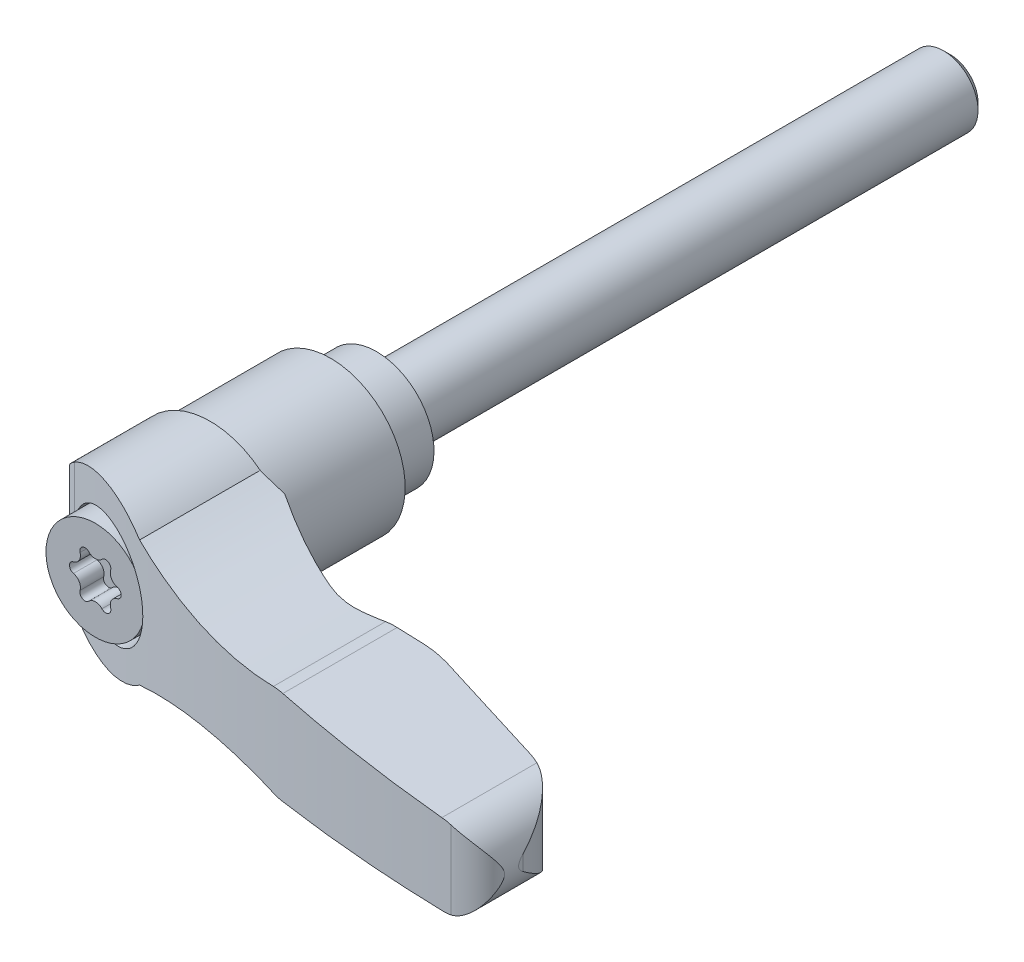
ISO-10303-21;
HEADER;
FILE_DESCRIPTION(('STEP AP214'),'2;1');
FILE_NAME('part.step','',(''),(''),'','','');
FILE_SCHEMA(('AUTOMOTIVE_DESIGN { 1 0 10303 214 1 1 1 1 }'));
ENDSEC;
DATA;
#1=APPLICATION_CONTEXT('core data for automotive mechanical design processes');
#2=APPLICATION_PROTOCOL_DEFINITION('international standard','automotive_design',2000,#1);
#3=PRODUCT_CONTEXT('',#1,'mechanical');
#4=PRODUCT('Part','Part','',(#3));
#5=PRODUCT_RELATED_PRODUCT_CATEGORY('part','',(#4));
#6=PRODUCT_DEFINITION_FORMATION('','',#4);
#7=PRODUCT_DEFINITION_CONTEXT('part definition',#1,'design');
#8=PRODUCT_DEFINITION('design','',#6,#7);
#9=PRODUCT_DEFINITION_SHAPE('','',#8);
#10=(LENGTH_UNIT() NAMED_UNIT(*) SI_UNIT(.MILLI.,.METRE.));
#11=(NAMED_UNIT(*) PLANE_ANGLE_UNIT() SI_UNIT($,.RADIAN.));
#12=(NAMED_UNIT(*) SI_UNIT($,.STERADIAN.) SOLID_ANGLE_UNIT());
#13=UNCERTAINTY_MEASURE_WITH_UNIT(LENGTH_MEASURE(1.E-05),#10,'distance_accuracy_value','');
#14=(GEOMETRIC_REPRESENTATION_CONTEXT(3) GLOBAL_UNCERTAINTY_ASSIGNED_CONTEXT((#13)) GLOBAL_UNIT_ASSIGNED_CONTEXT((#10,
#11,#12)) REPRESENTATION_CONTEXT('',''));
#15=CARTESIAN_POINT('',(0.,0.,0.));
#16=DIRECTION('',(0.,0.,1.));
#17=DIRECTION('',(1.,0.,0.));
#18=AXIS2_PLACEMENT_3D('',#15,#16,#17);
#19=CARTESIAN_POINT('',(0.,0.,-4.6928325));
#20=DIRECTION('',(0.,0.,-1.));
#21=DIRECTION('',(0.,1.,0.));
#22=AXIS2_PLACEMENT_3D('',#19,#20,#21);
#23=CYLINDRICAL_SURFACE('',#22,3.);
#24=CARTESIAN_POINT('',(0.,0.,-49.39));
#25=DIRECTION('',(0.,0.,-1.));
#26=DIRECTION('',(0.,1.,0.));
#27=AXIS2_PLACEMENT_3D('',#24,#25,#26);
#28=CIRCLE('',#27,3.);
#29=CARTESIAN_POINT('',(0.,3.,-49.39));
#30=VERTEX_POINT('',#29);
#31=EDGE_CURVE('E9',#30,#30,#28,.F.);
#32=ORIENTED_EDGE('',*,*,#31,.T.);
#33=EDGE_LOOP('',(#32));
#34=FACE_BOUND('',#33,.T.);
#35=CARTESIAN_POINT('',(0.,0.,0.));
#36=DIRECTION('',(0.,0.,-1.));
#37=DIRECTION('',(0.,1.,0.));
#38=AXIS2_PLACEMENT_3D('',#35,#36,#37);
#39=CIRCLE('',#38,3.);
#40=CARTESIAN_POINT('',(0.,3.,0.));
#41=VERTEX_POINT('',#40);
#42=EDGE_CURVE('E565',#41,#41,#39,.F.);
#43=ORIENTED_EDGE('',*,*,#42,.F.);
#44=EDGE_LOOP('',(#43));
#45=FACE_BOUND('',#44,.T.);
#46=ADVANCED_FACE('F14',(#34,#45),#23,.T.);
#47=CARTESIAN_POINT('',(4.,0.,0.));
#48=DIRECTION('',(0.,0.,-1.));
#49=DIRECTION('',(0.,1.,0.));
#50=AXIS2_PLACEMENT_3D('',#47,#48,#49);
#51=PLANE('',#50);
#52=ORIENTED_EDGE('',*,*,#42,.T.);
#53=EDGE_LOOP('',(#52));
#54=FACE_BOUND('',#53,.T.);
#55=CARTESIAN_POINT('',(0.,0.,0.));
#56=DIRECTION('',(0.,0.,-1.));
#57=DIRECTION('',(0.,1.,0.));
#58=AXIS2_PLACEMENT_3D('',#55,#56,#57);
#59=CIRCLE('',#58,5.);
#60=CARTESIAN_POINT('',(0.,5.,0.));
#61=VERTEX_POINT('',#60);
#62=EDGE_CURVE('E725',#61,#61,#59,.F.);
#63=ORIENTED_EDGE('',*,*,#62,.F.);
#64=EDGE_LOOP('',(#63));
#65=FACE_BOUND('',#64,.T.);
#66=ADVANCED_FACE('F668',(#54,#65),#51,.T.);
#67=CARTESIAN_POINT('',(0.,0.,6.4));
#68=DIRECTION('',(0.,0.,-1.));
#69=DIRECTION('',(0.,1.,0.));
#70=AXIS2_PLACEMENT_3D('',#67,#68,#69);
#71=CYLINDRICAL_SURFACE('',#70,5.);
#72=ORIENTED_EDGE('',*,*,#62,.T.);
#73=EDGE_LOOP('',(#72));
#74=FACE_BOUND('',#73,.T.);
#75=CARTESIAN_POINT('',(0.,0.,4.55000000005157));
#76=DIRECTION('',(0.,0.,-1.));
#77=DIRECTION('',(1.,0.,0.));
#78=AXIS2_PLACEMENT_3D('',#75,#76,#77);
#79=CIRCLE('',#78,4.99999999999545);
#80=CARTESIAN_POINT('',(4.99999999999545,0.,4.55000000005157));
#81=VERTEX_POINT('',#80);
#82=EDGE_CURVE('E558',#81,#81,#79,.T.);
#83=ORIENTED_EDGE('',*,*,#82,.T.);
#84=EDGE_LOOP('',(#83));
#85=FACE_BOUND('',#84,.T.);
#86=ADVANCED_FACE('F675',(#74,#85),#71,.T.);
#87=CARTESIAN_POINT('',(0.,0.,4.30000000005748));
#88=DIRECTION('',(0.,0.,-1.));
#89=DIRECTION('',(0.,1.,0.));
#90=AXIS2_PLACEMENT_3D('',#87,#88,#89);
#91=CONICAL_SURFACE('',#90,5.24999999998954,0.785398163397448);
#92=ORIENTED_EDGE('',*,*,#82,.F.);
#93=EDGE_LOOP('',(#92));
#94=FACE_BOUND('',#93,.T.);
#95=CARTESIAN_POINT('',(0.,0.,4.3));
#96=DIRECTION('',(0.,0.,-1.));
#97=DIRECTION('',(0.,1.,0.));
#98=AXIS2_PLACEMENT_3D('',#95,#96,#97);
#99=CIRCLE('',#98,5.25);
#100=CARTESIAN_POINT('',(0.,5.25,4.3));
#101=VERTEX_POINT('',#100);
#102=EDGE_CURVE('E554',#101,#101,#99,.T.);
#103=ORIENTED_EDGE('',*,*,#102,.T.);
#104=EDGE_LOOP('',(#103));
#105=FACE_BOUND('',#104,.T.);
#106=ADVANCED_FACE('F683',(#94,#105),#91,.F.);
#107=CARTESIAN_POINT('',(0.,0.,3.65));
#108=DIRECTION('',(0.,0.,-1.));
#109=DIRECTION('',(0.,1.,0.));
#110=AXIS2_PLACEMENT_3D('',#107,#108,#109);
#111=CYLINDRICAL_SURFACE('',#110,5.25);
#112=ORIENTED_EDGE('',*,*,#102,.F.);
#113=EDGE_LOOP('',(#112));
#114=FACE_BOUND('',#113,.T.);
#115=CARTESIAN_POINT('',(0.,0.,4.));
#116=DIRECTION('',(0.,0.,-1.));
#117=DIRECTION('',(0.,1.,0.));
#118=AXIS2_PLACEMENT_3D('',#115,#116,#117);
#119=CIRCLE('',#118,5.25);
#120=CARTESIAN_POINT('',(0.,5.25,4.));
#121=VERTEX_POINT('',#120);
#122=EDGE_CURVE('E713',#121,#121,#119,.F.);
#123=ORIENTED_EDGE('',*,*,#122,.F.);
#124=EDGE_LOOP('',(#123));
#125=FACE_BOUND('',#124,.T.);
#126=ADVANCED_FACE('F690',(#114,#125),#111,.F.);
#127=CARTESIAN_POINT('',(-6.36002265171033,-14.,4.));
#128=DIRECTION('',(0.707106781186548,0.,0.707106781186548));
#129=DIRECTION('',(-0.707106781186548,0.,0.707106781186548));
#130=AXIS2_PLACEMENT_3D('',#127,#128,#129);
#131=PLANE('',#130);
#132=DIRECTION('',(0.,1.,0.));
#133=VECTOR('',#132,1.);
#134=CARTESIAN_POINT('',(-6.36002265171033,0.,4.));
#135=LINE('',#134,#133);
#136=CARTESIAN_POINT('',(-6.36002265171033,-1.38824072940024,4.));
#137=VERTEX_POINT('',#136);
#138=CARTESIAN_POINT('',(-6.36002265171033,1.38824072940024,4.));
#139=VERTEX_POINT('',#138);
#140=EDGE_CURVE('E715',#137,#139,#135,.T.);
#141=ORIENTED_EDGE('',*,*,#140,.F.);
#142=CARTESIAN_POINT('',(-0.0100000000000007,0.,-2.35002265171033));
#143=DIRECTION('',(0.707106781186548,0.,0.707106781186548));
#144=DIRECTION('',(-0.707106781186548,0.,0.707106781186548));
#145=AXIS2_PLACEMENT_3D('',#142,#143,#144);
#146=ELLIPSE('',#145,9.19238815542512,6.5);
#147=EDGE_CURVE('E557',#139,#137,#146,.T.);
#148=ORIENTED_EDGE('',*,*,#147,.F.);
#149=EDGE_LOOP('',(#141,#148));
#150=FACE_BOUND('',#149,.T.);
#151=ADVANCED_FACE('F694',(#150),#131,.F.);
#152=CARTESIAN_POINT('',(-3.26,0.,4.));
#153=DIRECTION('',(0.,0.,-1.));
#154=DIRECTION('',(0.,1.,0.));
#155=AXIS2_PLACEMENT_3D('',#152,#153,#154);
#156=PLANE('',#155);
#157=CARTESIAN_POINT('',(-0.00999999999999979,0.,4.));
#158=DIRECTION('',(0.,0.,1.));
#159=DIRECTION('',(-1.,0.,0.));
#160=AXIS2_PLACEMENT_3D('',#157,#158,#159);
#161=CIRCLE('',#160,6.5);
#162=EDGE_CURVE('E709',#137,#139,#161,.T.);
#163=ORIENTED_EDGE('',*,*,#162,.F.);
#164=ORIENTED_EDGE('',*,*,#140,.T.);
#165=EDGE_LOOP('',(#163,#164));
#166=FACE_BOUND('',#165,.T.);
#167=ORIENTED_EDGE('',*,*,#122,.T.);
#168=EDGE_LOOP('',(#167));
#169=FACE_BOUND('',#168,.T.);
#170=ADVANCED_FACE('F697',(#166,#169),#156,.T.);
#171=CARTESIAN_POINT('',(39.9389658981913,-8.,27.2042491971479));
#172=DIRECTION('',(0.989626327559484,0.,-0.143665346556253));
#173=DIRECTION('',(0.143665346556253,0.,0.989626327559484));
#174=AXIS2_PLACEMENT_3D('',#171,#172,#173);
#175=PLANE('',#174);
#176=CARTESIAN_POINT('',(36.5,0.,3.51522972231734));
#177=DIRECTION('',(0.989626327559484,0.,-0.143665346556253));
#178=DIRECTION('',(0.143665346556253,0.,0.989626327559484));
#179=AXIS2_PLACEMENT_3D('',#176,#177,#178);
#180=ELLIPSE('',#179,24.3621728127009,3.5);
#181=CARTESIAN_POINT('',(39.9389658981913,-0.650779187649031,27.2042491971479));
#182=VERTEX_POINT('',#181);
#183=CARTESIAN_POINT('',(39.9389658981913,0.650779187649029,27.2042491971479));
#184=VERTEX_POINT('',#183);
#185=EDGE_CURVE('E461',#182,#184,#180,.F.);
#186=ORIENTED_EDGE('',*,*,#185,.F.);
#187=DIRECTION('',(0.,-1.,0.));
#188=VECTOR('',#187,1.);
#189=CARTESIAN_POINT('',(39.9389658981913,-8.,27.2042491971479));
#190=LINE('',#189,#188);
#191=EDGE_CURVE('E848',#184,#182,#190,.T.);
#192=ORIENTED_EDGE('',*,*,#191,.F.);
#193=EDGE_LOOP('',(#186,#192));
#194=FACE_BOUND('',#193,.T.);
#195=ADVANCED_FACE('F485',(#194),#175,.T.);
#196=CARTESIAN_POINT('',(33.8626602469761,-8.,28.0863544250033));
#197=DIRECTION('',(0.,-1.,0.));
#198=DIRECTION('',(1.,0.,0.));
#199=AXIS2_PLACEMENT_3D('',#196,#197,#198);
#200=CYLINDRICAL_SURFACE('',#199,6.14);
#201=ORIENTED_EDGE('',*,*,#191,.T.);
#202=CARTESIAN_POINT('',(36.5,-3.5,22.5416236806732));
#203=CARTESIAN_POINT('',(36.6061539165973,-3.50000941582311,22.5920863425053));
#204=CARTESIAN_POINT('',(36.7107657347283,-3.49517280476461,22.6456099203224));
#205=CARTESIAN_POINT('',(36.9160027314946,-3.47671082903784,22.758101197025));
#206=CARTESIAN_POINT('',(37.0166343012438,-3.46310021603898,22.8170596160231));
#207=CARTESIAN_POINT('',(37.2123479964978,-3.42816986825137,22.9392782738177));
#208=CARTESIAN_POINT('',(37.3074768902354,-3.40693163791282,23.002487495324));
#209=CARTESIAN_POINT('',(37.4929223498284,-3.3575759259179,23.13320682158));
#210=CARTESIAN_POINT('',(37.5832363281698,-3.32945478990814,23.2007191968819));
#211=CARTESIAN_POINT('',(37.7830795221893,-3.25850520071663,23.358740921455));
#212=CARTESIAN_POINT('',(37.8909927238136,-3.21376078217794,23.4504360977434));
#213=CARTESIAN_POINT('',(38.0982482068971,-3.11588681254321,23.6389903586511));
#214=CARTESIAN_POINT('',(38.1975840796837,-3.06275107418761,23.7358532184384));
#215=CARTESIAN_POINT('',(38.3880468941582,-2.94917464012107,23.9343090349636));
#216=CARTESIAN_POINT('',(38.4791322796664,-2.88870020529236,24.0359224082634));
#217=CARTESIAN_POINT('',(38.6526412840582,-2.76182607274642,24.2426721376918));
#218=CARTESIAN_POINT('',(38.7350674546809,-2.69542813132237,24.3478074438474));
#219=CARTESIAN_POINT('',(38.9229341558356,-2.52996933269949,24.6038856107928));
#220=CARTESIAN_POINT('',(39.0243159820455,-2.42850340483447,24.7562617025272));
#221=CARTESIAN_POINT('',(39.2111706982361,-2.21796613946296,25.0654781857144));
#222=CARTESIAN_POINT('',(39.2966363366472,-2.10889136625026,25.2223205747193));
#223=CARTESIAN_POINT('',(39.452222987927,-1.88493092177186,25.5392893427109));
#224=CARTESIAN_POINT('',(39.5223498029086,-1.77004746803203,25.699414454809));
#225=CARTESIAN_POINT('',(39.6478320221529,-1.53583460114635,26.0220530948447));
#226=CARTESIAN_POINT('',(39.7031929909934,-1.41650688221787,26.1845656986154));
#227=CARTESIAN_POINT('',(39.7933776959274,-1.1901857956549,26.4900634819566));
#228=CARTESIAN_POINT('',(39.8299343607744,-1.08360162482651,26.6328455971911));
#229=CARTESIAN_POINT('',(39.8923391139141,-0.86858691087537,26.918504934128));
#230=CARTESIAN_POINT('',(39.918226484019,-0.76016469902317,27.0613798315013));
#231=CARTESIAN_POINT('',(39.9389658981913,-0.650779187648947,27.204249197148));
#232=B_SPLINE_CURVE_WITH_KNOTS('',3,(#202,#203,#204,#205,#206,#207,#208,#209,#210,#211,#212,
#213,#214,#215,#216,#217,#218,#219,#220,#221,#222,#223,#224,#225,#226,#227,#228,#229,#230,#231),
.UNSPECIFIED.,.F.,.F.,(4,2,2,2,2,2,2,2,2,2,2,2,2,2,4),(0.,0.352350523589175,0.704110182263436,
1.05221781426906,1.40051067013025,1.84538152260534,2.29058194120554,2.73791274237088,
3.18511134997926,3.81198117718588,4.43913591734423,5.06605301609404,5.69273352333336,
6.23807905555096,6.78139842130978),.UNSPECIFIED.);
#233=CARTESIAN_POINT('',(36.5,-3.5,22.5416236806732));
#234=VERTEX_POINT('',#233);
#235=EDGE_CURVE('E465',#234,#182,#232,.T.);
#236=ORIENTED_EDGE('',*,*,#235,.F.);
#237=CARTESIAN_POINT('',(33.8626602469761,-3.59762871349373,28.0863544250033));
#238=DIRECTION('',(-0.0369925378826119,0.999315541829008,0.));
#239=DIRECTION('',(-0.999315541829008,-0.0369925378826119,0.));
#240=AXIS2_PLACEMENT_3D('',#237,#238,#239);
#241=ELLIPSE('',#240,6.14420545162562,6.14);
#242=CARTESIAN_POINT('',(35.5344609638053,-3.53574220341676,22.1783359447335));
#243=VERTEX_POINT('',#242);
#244=EDGE_CURVE('E717',#234,#243,#241,.T.);
#245=ORIENTED_EDGE('',*,*,#244,.T.);
#246=DIRECTION('',(0.,-1.,0.));
#247=VECTOR('',#246,1.);
#248=CARTESIAN_POINT('',(35.5344609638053,-8.,22.1783359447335));
#249=LINE('',#248,#247);
#250=CARTESIAN_POINT('',(35.5344609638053,3.53574220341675,22.1783359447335));
#251=VERTEX_POINT('',#250);
#252=EDGE_CURVE('E539',#251,#243,#249,.T.);
#253=ORIENTED_EDGE('',*,*,#252,.F.);
#254=CARTESIAN_POINT('',(33.8626602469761,3.59762871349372,28.0863544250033));
#255=DIRECTION('',(-0.036992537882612,-0.999315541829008,0.));
#256=DIRECTION('',(0.999315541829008,-0.036992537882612,0.));
#257=AXIS2_PLACEMENT_3D('',#254,#255,#256);
#258=ELLIPSE('',#257,6.14420545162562,6.14);
#259=CARTESIAN_POINT('',(36.5,3.5,22.5416236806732));
#260=VERTEX_POINT('',#259);
#261=EDGE_CURVE('E847',#251,#260,#258,.T.);
#262=ORIENTED_EDGE('',*,*,#261,.T.);
#263=CARTESIAN_POINT('',(39.9389658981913,0.65077918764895,27.204249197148));
#264=CARTESIAN_POINT('',(39.9247028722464,0.726086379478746,27.1059853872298));
#265=CARTESIAN_POINT('',(39.9079968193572,0.800887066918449,27.0076860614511));
#266=CARTESIAN_POINT('',(39.8696347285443,0.949458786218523,26.8112602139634));
#267=CARTESIAN_POINT('',(39.8479781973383,1.02322971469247,26.7131337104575));
#268=CARTESIAN_POINT('',(39.7995979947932,1.169880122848,26.5170899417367));
#269=CARTESIAN_POINT('',(39.7728626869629,1.24275713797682,26.4191736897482));
#270=CARTESIAN_POINT('',(39.7142815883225,1.38725410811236,26.2239599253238));
#271=CARTESIAN_POINT('',(39.6824358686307,1.4588740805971,26.1266624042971));
#272=CARTESIAN_POINT('',(39.5782917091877,1.67318502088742,25.8337016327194));
#273=CARTESIAN_POINT('',(39.4979263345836,1.81366367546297,25.6391889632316));
#274=CARTESIAN_POINT('',(39.3150854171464,2.08619457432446,25.2551202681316));
#275=CARTESIAN_POINT('',(39.2126344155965,2.218255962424,25.0655590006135));
#276=CARTESIAN_POINT('',(38.9595027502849,2.49877334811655,24.6523338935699));
#277=CARTESIAN_POINT('',(38.8031801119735,2.64456339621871,24.4302018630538));
#278=CARTESIAN_POINT('',(38.5417124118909,2.84488994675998,24.1082756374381));
#279=CARTESIAN_POINT('',(38.4501831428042,2.90854134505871,24.0029632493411));
#280=CARTESIAN_POINT('',(38.2579442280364,3.02861213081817,23.7967186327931));
#281=CARTESIAN_POINT('',(38.1572360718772,3.08503268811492,23.6957856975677));
#282=CARTESIAN_POINT('',(37.8892625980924,3.21757634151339,23.4457323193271));
#283=CARTESIAN_POINT('',(37.7155213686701,3.28779061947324,23.3001643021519));
#284=CARTESIAN_POINT('',(37.4396992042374,3.37286339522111,23.0946053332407));
#285=CARTESIAN_POINT('',(37.3453175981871,3.39783246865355,23.0282732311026));
#286=CARTESIAN_POINT('',(37.1517842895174,3.44019984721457,22.9003457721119));
#287=CARTESIAN_POINT('',(37.0526354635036,3.45760265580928,22.8387476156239));
#288=CARTESIAN_POINT('',(36.8781783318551,3.48029211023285,22.7372021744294));
#289=CARTESIAN_POINT('',(36.8038676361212,3.48759914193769,22.6959814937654));
#290=CARTESIAN_POINT('',(36.6533047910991,3.497455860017,22.6165121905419));
#291=CARTESIAN_POINT('',(36.5770513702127,3.50000234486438,22.5782655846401));
#292=CARTESIAN_POINT('',(36.5,3.5,22.5416236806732));
#293=B_SPLINE_CURVE_WITH_KNOTS('',3,(#263,#264,#265,#266,#267,#268,#269,#270,#271,#272,#273,
#274,#275,#276,#277,#278,#279,#280,#281,#282,#283,#284,#285,#286,#287,#288,#289,#290,#291,#292),
.UNSPECIFIED.,.F.,.F.,(4,2,2,2,2,2,2,2,2,2,2,2,2,2,4),(0.,0.373839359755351,0.747715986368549,
1.12245980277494,1.49719840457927,2.25512351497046,3.01221072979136,3.93367725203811,
4.39332639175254,4.85290107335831,5.56171222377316,5.91546495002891,6.26900683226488,
6.52468766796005,6.78054039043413),.UNSPECIFIED.);
#294=EDGE_CURVE('E434',#184,#260,#293,.T.);
#295=ORIENTED_EDGE('',*,*,#294,.F.);
#296=EDGE_LOOP('',(#201,#236,#245,#253,#262,#295));
#297=FACE_BOUND('',#296,.T.);
#298=ADVANCED_FACE('F479',(#297),#200,.T.);
#299=CARTESIAN_POINT('',(-0.0099999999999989,0.,10.28125));
#300=DIRECTION('',(0.,0.,1.));
#301=DIRECTION('',(-1.,0.,0.));
#302=AXIS2_PLACEMENT_3D('',#299,#300,#301);
#303=CYLINDRICAL_SURFACE('',#302,6.5);
#304=CARTESIAN_POINT('',(-0.00999999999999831,0.,14.5));
#305=DIRECTION('',(0.,0.,1.));
#306=DIRECTION('',(-1.,0.,0.));
#307=AXIS2_PLACEMENT_3D('',#304,#305,#306);
#308=CIRCLE('',#307,6.5);
#309=CARTESIAN_POINT('',(-6.51,0.,14.5));
#310=VERTEX_POINT('',#309);
#311=CARTESIAN_POINT('',(6.49,0.,14.5));
#312=VERTEX_POINT('',#311);
#313=EDGE_CURVE('E850',#310,#312,#308,.T.);
#314=ORIENTED_EDGE('',*,*,#313,.F.);
#315=CARTESIAN_POINT('',(-0.00999999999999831,0.,14.5));
#316=DIRECTION('',(0.,0.,1.));
#317=DIRECTION('',(-1.,0.,0.));
#318=AXIS2_PLACEMENT_3D('',#315,#316,#317);
#319=CIRCLE('',#318,6.5);
#320=EDGE_CURVE('E536',#312,#310,#319,.T.);
#321=ORIENTED_EDGE('',*,*,#320,.F.);
#322=EDGE_LOOP('',(#314,#321));
#323=FACE_BOUND('',#322,.T.);
#324=ORIENTED_EDGE('',*,*,#162,.T.);
#325=ORIENTED_EDGE('',*,*,#147,.T.);
#326=EDGE_LOOP('',(#324,#325));
#327=FACE_BOUND('',#326,.T.);
#328=ADVANCED_FACE('F484',(#323,#327),#303,.T.);
#329=CARTESIAN_POINT('',(-6.51,-8.,14.5));
#330=DIRECTION('',(0.,0.,-1.));
#331=DIRECTION('',(0.,1.,0.));
#332=AXIS2_PLACEMENT_3D('',#329,#330,#331);
#333=PLANE('',#332);
#334=ORIENTED_EDGE('',*,*,#313,.T.);
#335=DIRECTION('',(0.,-1.,0.));
#336=VECTOR('',#335,1.);
#337=CARTESIAN_POINT('',(6.49,-8.,14.5));
#338=LINE('',#337,#336);
#339=CARTESIAN_POINT('',(6.49,-4.77390244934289,14.5));
#340=VERTEX_POINT('',#339);
#341=EDGE_CURVE('E853',#312,#340,#338,.T.);
#342=ORIENTED_EDGE('',*,*,#341,.T.);
#343=CARTESIAN_POINT('',(14.8,-33.6,14.5));
#344=DIRECTION('',(0.,0.,1.));
#345=DIRECTION('',(0.,-1.,0.));
#346=AXIS2_PLACEMENT_3D('',#343,#344,#345);
#347=CIRCLE('',#346,30.);
#348=CARTESIAN_POINT('',(4.36278582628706,-5.47413005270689,14.5));
#349=VERTEX_POINT('',#348);
#350=EDGE_CURVE('E810',#340,#349,#347,.T.);
#351=ORIENTED_EDGE('',*,*,#350,.T.);
#352=CARTESIAN_POINT('',(0.,0.,14.5));
#353=DIRECTION('',(0.,0.,1.));
#354=DIRECTION('',(0.,-1.,0.));
#355=AXIS2_PLACEMENT_3D('',#352,#353,#354);
#356=CIRCLE('',#355,7.);
#357=CARTESIAN_POINT('',(-6.51,-2.57291663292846,14.5));
#358=VERTEX_POINT('',#357);
#359=EDGE_CURVE('E372',#358,#349,#356,.T.);
#360=ORIENTED_EDGE('',*,*,#359,.F.);
#361=DIRECTION('',(0.,-1.,0.));
#362=VECTOR('',#361,1.);
#363=CARTESIAN_POINT('',(-6.51,-8.,14.5));
#364=LINE('',#363,#362);
#365=EDGE_CURVE('E535',#310,#358,#364,.T.);
#366=ORIENTED_EDGE('',*,*,#365,.F.);
#367=EDGE_LOOP('',(#334,#342,#351,#360,#366));
#368=FACE_BOUND('',#367,.T.);
#369=ADVANCED_FACE('F490',(#368),#333,.T.);
#370=CARTESIAN_POINT('',(20.6060580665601,0.915064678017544,31.));
#371=DIRECTION('',(0.,0.,1.));
#372=DIRECTION('',(0.,-1.,0.));
#373=AXIS2_PLACEMENT_3D('',#370,#371,#372);
#374=CYLINDRICAL_SURFACE('',#373,5.);
#375=CARTESIAN_POINT('',(20.7910207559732,-4.08151303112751,28.9575923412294));
#376=CARTESIAN_POINT('',(20.6207575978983,-4.08776311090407,28.9275070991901));
#377=CARTESIAN_POINT('',(20.4510927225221,-4.08540030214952,28.8972050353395));
#378=CARTESIAN_POINT('',(20.1129595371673,-4.06344890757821,28.8361672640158));
#379=CARTESIAN_POINT('',(19.9444912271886,-4.04386032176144,28.8054315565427));
#380=CARTESIAN_POINT('',(19.7766211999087,-4.01565884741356,28.7744790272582));
#381=B_SPLINE_CURVE_WITH_KNOTS('',3,(#375,#376,#377,#378,#379,#380),.UNSPECIFIED.,.F.,.F.,(4,2,
4),(0.,0.517097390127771,1.03419478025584),.UNSPECIFIED.);
#382=CARTESIAN_POINT('',(20.7910207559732,-4.08151303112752,28.9575923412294));
#383=VERTEX_POINT('',#382);
#384=CARTESIAN_POINT('',(19.7766211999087,-4.01565884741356,28.7744790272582));
#385=VERTEX_POINT('',#384);
#386=EDGE_CURVE('E468',#383,#385,#381,.T.);
#387=ORIENTED_EDGE('',*,*,#386,.T.);
#388=DIRECTION('',(0.,0.,1.));
#389=VECTOR('',#388,1.);
#390=CARTESIAN_POINT('',(19.7766211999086,-4.01565884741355,31.));
#391=LINE('',#390,#389);
#392=CARTESIAN_POINT('',(19.7766211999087,-4.01565884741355,19.));
#393=VERTEX_POINT('',#392);
#394=EDGE_CURVE('E803',#385,#393,#391,.F.);
#395=ORIENTED_EDGE('',*,*,#394,.T.);
#396=CARTESIAN_POINT('',(20.6060580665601,0.915064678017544,19.));
#397=DIRECTION('',(0.,0.,1.));
#398=DIRECTION('',(0.,-1.,0.));
#399=AXIS2_PLACEMENT_3D('',#396,#397,#398);
#400=CIRCLE('',#399,5.);
#401=CARTESIAN_POINT('',(20.7910207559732,-4.08151303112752,19.));
#402=VERTEX_POINT('',#401);
#403=EDGE_CURVE('E857',#402,#393,#400,.F.);
#404=ORIENTED_EDGE('',*,*,#403,.F.);
#405=DIRECTION('',(0.,0.,1.));
#406=VECTOR('',#405,1.);
#407=CARTESIAN_POINT('',(20.7910207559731,-4.08151303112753,31.));
#408=LINE('',#407,#406);
#409=EDGE_CURVE('E809',#402,#383,#408,.T.);
#410=ORIENTED_EDGE('',*,*,#409,.T.);
#411=EDGE_LOOP('',(#387,#395,#404,#410));
#412=FACE_BOUND('',#411,.T.);
#413=ADVANCED_FACE('F426',(#412),#374,.T.);
#414=CARTESIAN_POINT('',(36.5,0.,31.));
#415=DIRECTION('',(0.,0.,1.));
#416=DIRECTION('',(0.,-1.,0.));
#417=AXIS2_PLACEMENT_3D('',#414,#415,#416);
#418=CYLINDRICAL_SURFACE('',#417,3.5);
#419=CARTESIAN_POINT('',(37.3240183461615,-3.40161634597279,30.8631619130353));
#420=CARTESIAN_POINT('',(37.188603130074,-3.43435641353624,30.8557619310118));
#421=CARTESIAN_POINT('',(37.0522273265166,-3.45892508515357,30.8481012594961));
#422=CARTESIAN_POINT('',(36.7775545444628,-3.49171963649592,30.8322585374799));
#423=CARTESIAN_POINT('',(36.6392575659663,-3.499945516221,30.8240764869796));
#424=CARTESIAN_POINT('',(36.5,-3.5,30.815633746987));
#425=B_SPLINE_CURVE_WITH_KNOTS('',3,(#419,#420,#421,#422,#423,#424),.UNSPECIFIED.,.F.,.F.,(4,2,
4),(0.,0.416348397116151,0.832696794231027),.UNSPECIFIED.);
#426=CARTESIAN_POINT('',(37.3240183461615,-3.40161634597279,30.8631619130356));
#427=VERTEX_POINT('',#426);
#428=CARTESIAN_POINT('',(36.5,-3.5,30.815633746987));
#429=VERTEX_POINT('',#428);
#430=EDGE_CURVE('E446',#427,#429,#425,.T.);
#431=ORIENTED_EDGE('',*,*,#430,.T.);
#432=DIRECTION('',(0.,0.,1.));
#433=VECTOR('',#432,1.);
#434=CARTESIAN_POINT('',(36.5,-3.5,31.));
#435=LINE('',#434,#433);
#436=EDGE_CURVE('E820',#429,#234,#435,.F.);
#437=ORIENTED_EDGE('',*,*,#436,.T.);
#438=ORIENTED_EDGE('',*,*,#235,.T.);
#439=ORIENTED_EDGE('',*,*,#185,.T.);
#440=ORIENTED_EDGE('',*,*,#294,.T.);
#441=DIRECTION('',(0.,0.,1.));
#442=VECTOR('',#441,1.);
#443=CARTESIAN_POINT('',(36.5,3.5,31.));
#444=LINE('',#443,#442);
#445=CARTESIAN_POINT('',(36.5,3.5,30.815633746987));
#446=VERTEX_POINT('',#445);
#447=EDGE_CURVE('E414',#260,#446,#444,.T.);
#448=ORIENTED_EDGE('',*,*,#447,.T.);
#449=CARTESIAN_POINT('',(36.5,3.5,30.815633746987));
#450=CARTESIAN_POINT('',(36.6392575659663,3.499945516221,30.8240764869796));
#451=CARTESIAN_POINT('',(36.7775545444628,3.49171963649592,30.8322585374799));
#452=CARTESIAN_POINT('',(37.0522273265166,3.45892508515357,30.8481012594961));
#453=CARTESIAN_POINT('',(37.188603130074,3.43435641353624,30.8557619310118));
#454=CARTESIAN_POINT('',(37.3240183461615,3.40161634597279,30.8631619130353));
#455=B_SPLINE_CURVE_WITH_KNOTS('',3,(#449,#450,#451,#452,#453,#454),.UNSPECIFIED.,.F.,.F.,(4,2,
4),(0.,0.416348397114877,0.832696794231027),.UNSPECIFIED.);
#456=CARTESIAN_POINT('',(37.3240183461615,3.40161634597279,30.8631619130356));
#457=VERTEX_POINT('',#456);
#458=EDGE_CURVE('E452',#446,#457,#455,.T.);
#459=ORIENTED_EDGE('',*,*,#458,.T.);
#460=CARTESIAN_POINT('',(37.3240183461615,-3.40161634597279,30.8631619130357));
#461=CARTESIAN_POINT('',(37.391971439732,-3.38517327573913,30.8668921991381));
#462=CARTESIAN_POINT('',(37.4595366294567,-3.36663320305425,30.8678982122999));
#463=CARTESIAN_POINT('',(37.5932555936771,-3.32560440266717,30.8647814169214));
#464=CARTESIAN_POINT('',(37.6594109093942,-3.30312026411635,30.8606645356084));
#465=CARTESIAN_POINT('',(37.7892420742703,-3.25463078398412,30.8476880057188));
#466=CARTESIAN_POINT('',(37.8529349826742,-3.22865926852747,30.8388717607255));
#467=CARTESIAN_POINT('',(37.9780608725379,-3.17332967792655,30.8169101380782));
#468=CARTESIAN_POINT('',(38.0394932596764,-3.14397072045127,30.8037636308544));
#469=CARTESIAN_POINT('',(38.2193405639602,-3.05154774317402,30.7585650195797));
#470=CARTESIAN_POINT('',(38.3339861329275,-2.98387991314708,30.7206782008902));
#471=CARTESIAN_POINT('',(38.5517467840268,-2.83858348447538,30.6324207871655));
#472=CARTESIAN_POINT('',(38.6548343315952,-2.76093200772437,30.5820212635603));
#473=CARTESIAN_POINT('',(38.8266237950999,-2.61655584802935,30.4842690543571));
#474=CARTESIAN_POINT('',(38.8977926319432,-2.55140368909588,30.4388637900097));
#475=CARTESIAN_POINT('',(39.0330318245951,-2.41719472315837,30.3433991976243));
#476=CARTESIAN_POINT('',(39.0970985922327,-2.34813596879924,30.2933375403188));
#477=CARTESIAN_POINT('',(39.2184581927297,-2.20651617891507,30.1893556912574));
#478=CARTESIAN_POINT('',(39.2757265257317,-2.13394372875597,30.1354226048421));
#479=CARTESIAN_POINT('',(39.3834200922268,-1.9860149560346,30.0247265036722));
#480=CARTESIAN_POINT('',(39.4338475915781,-1.91065956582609,29.9679644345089));
#481=CARTESIAN_POINT('',(39.542421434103,-1.73419420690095,29.8348143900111));
#482=CARTESIAN_POINT('',(39.598263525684,-1.63221056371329,29.7576996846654));
#483=CARTESIAN_POINT('',(39.699250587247,-1.42414609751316,29.601672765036));
#484=CARTESIAN_POINT('',(39.7443776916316,-1.31805876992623,29.5227577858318));
#485=CARTESIAN_POINT('',(39.8239747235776,-1.10201279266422,29.3659397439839));
#486=CARTESIAN_POINT('',(39.8584944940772,-0.992075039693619,29.2880336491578));
#487=CARTESIAN_POINT('',(39.9024720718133,-0.82253324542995,29.1754655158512));
#488=CARTESIAN_POINT('',(39.9158188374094,-0.765322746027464,29.13870216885));
#489=CARTESIAN_POINT('',(39.9398686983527,-0.648731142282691,29.0678855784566));
#490=CARTESIAN_POINT('',(39.9505741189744,-0.589352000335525,29.0338299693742));
#491=CARTESIAN_POINT('',(39.9677206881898,-0.477086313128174,28.9756719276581));
#492=CARTESIAN_POINT('',(39.974567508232,-0.424644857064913,28.9508463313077));
#493=CARTESIAN_POINT('',(39.9860225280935,-0.317100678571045,28.907341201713));
#494=CARTESIAN_POINT('',(39.9906385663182,-0.262008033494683,28.8886402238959));
#495=CARTESIAN_POINT('',(39.9966232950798,-0.160247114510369,28.8637621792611));
#496=CARTESIAN_POINT('',(39.9984523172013,-0.114054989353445,28.8558445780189));
#497=CARTESIAN_POINT('',(40.0002450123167,-0.0209847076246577,28.8480882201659));
#498=CARTESIAN_POINT('',(40.0002117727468,0.0258921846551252,28.8482360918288));
#499=CARTESIAN_POINT('',(39.9982952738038,0.118672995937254,28.8565205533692));
#500=CARTESIAN_POINT('',(39.9964185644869,0.164579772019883,28.8646288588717));
#501=CARTESIAN_POINT('',(39.9910078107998,0.254792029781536,28.8870889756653));
#502=CARTESIAN_POINT('',(39.9874686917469,0.299092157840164,28.9014598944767));
#503=CARTESIAN_POINT('',(39.9768286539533,0.407331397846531,28.9425912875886));
#504=CARTESIAN_POINT('',(39.9688318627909,0.470155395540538,28.9719647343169));
#505=CARTESIAN_POINT('',(39.9499914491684,0.592804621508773,29.0357410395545));
#506=CARTESIAN_POINT('',(39.9391403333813,0.652621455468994,29.0701570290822));
#507=CARTESIAN_POINT('',(39.9146680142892,0.770512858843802,29.1419527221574));
#508=CARTESIAN_POINT('',(39.9010255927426,0.828569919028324,29.1793537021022));
#509=CARTESIAN_POINT('',(39.8711029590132,0.942947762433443,29.2555520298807));
#510=CARTESIAN_POINT('',(39.8548256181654,0.999270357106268,29.2943478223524));
#511=CARTESIAN_POINT('',(39.8016739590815,1.1674299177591,29.4125134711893));
#512=CARTESIAN_POINT('',(39.7607265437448,1.27728939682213,29.4929030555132));
#513=CARTESIAN_POINT('',(39.6677865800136,1.49294867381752,29.6529500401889));
#514=CARTESIAN_POINT('',(39.6157834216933,1.59874445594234,29.7326066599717));
#515=CARTESIAN_POINT('',(39.5005966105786,1.80564912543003,29.8886982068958));
#516=CARTESIAN_POINT('',(39.4374685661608,1.90677830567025,29.9651469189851));
#517=CARTESIAN_POINT('',(39.2994325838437,2.10420227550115,30.1133265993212));
#518=CARTESIAN_POINT('',(39.2245348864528,2.20050117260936,30.1850615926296));
#519=CARTESIAN_POINT('',(39.0442952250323,2.40820732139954,30.3372677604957));
#520=CARTESIAN_POINT('',(38.9358891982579,2.51819093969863,30.4161164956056));
#521=CARTESIAN_POINT('',(38.7000552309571,2.72661786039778,30.559662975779));
#522=CARTESIAN_POINT('',(38.5726400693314,2.82506883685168,30.6243701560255));
#523=CARTESIAN_POINT('',(38.3254291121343,2.98922527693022,30.7237895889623));
#524=CARTESIAN_POINT('',(38.2087731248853,3.05759969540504,30.7618633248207));
#525=CARTESIAN_POINT('',(37.9650872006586,3.18151973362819,30.8217517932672));
#526=CARTESIAN_POINT('',(37.8380870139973,3.23710049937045,30.8436114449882));
#527=CARTESIAN_POINT('',(37.6449762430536,3.3080955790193,30.8616374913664));
#528=CARTESIAN_POINT('',(37.5816159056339,3.32934954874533,30.8652564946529));
#529=CARTESIAN_POINT('',(37.4536360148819,3.36824327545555,30.867801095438));
#530=CARTESIAN_POINT('',(37.389015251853,3.38587935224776,30.8667219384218));
#531=CARTESIAN_POINT('',(37.3240183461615,3.40161634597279,30.8631619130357));
#532=B_SPLINE_CURVE_WITH_KNOTS('',3,(#460,#461,#462,#463,#464,#465,#466,#467,#468,#469,#470,
#471,#472,#473,#474,#475,#476,#477,#478,#479,#480,#481,#482,#483,#484,#485,#486,#487,#488,#489,
#490,#491,#492,#493,#494,#495,#496,#497,#498,#499,#500,#501,#502,#503,#504,#505,#506,#507,#508,
#509,#510,#511,#512,#513,#514,#515,#516,#517,#518,#519,#520,#521,#522,#523,#524,#525,#526,#527,
#528,#529,#530,#531),.UNSPECIFIED.,.F.,.F.,(4,2,2,2,2,2,2,2,2,2,2,2,2,2,2,2,2,2,2,2,2,2,2,2,2,2,
2,2,2,2,2,2,2,2,2,4),(0.,0.20991378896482,0.419584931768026,0.62735226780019,0.83517384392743,
1.2486492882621,1.66308971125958,1.98257890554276,2.30222878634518,2.62299771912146,
2.94366014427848,3.36167065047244,3.78037330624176,4.19707731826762,4.40489951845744,
4.61253810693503,4.78756393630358,4.9619702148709,5.10204921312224,5.24189598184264,
5.38124764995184,5.52102749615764,5.72989301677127,5.9393124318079,6.15038720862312,
6.36123350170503,6.7871576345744,7.21349237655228,7.63775356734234,8.06164764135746,
8.58013018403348,9.09826573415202,9.51811060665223,9.9367879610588,10.1373304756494,
10.3380759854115),.UNSPECIFIED.);
#533=EDGE_CURVE('E406',#427,#457,#532,.T.);
#534=ORIENTED_EDGE('',*,*,#533,.F.);
#535=EDGE_LOOP('',(#431,#437,#438,#439,#440,#448,#459,#534));
#536=FACE_BOUND('',#535,.T.);
#537=ADVANCED_FACE('F420',(#536),#418,.T.);
#538=CARTESIAN_POINT('',(23.0466685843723,-8.,28.05));
#539=DIRECTION('',(0.,-1.,0.));
#540=DIRECTION('',(1.,0.,0.));
#541=AXIS2_PLACEMENT_3D('',#538,#539,#540);
#542=CYLINDRICAL_SURFACE('',#541,9.05000000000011);
#543=CARTESIAN_POINT('',(23.0466685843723,3.99801374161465,28.05));
#544=DIRECTION('',(-0.036992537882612,-0.999315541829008,0.));
#545=DIRECTION('',(0.999315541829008,-0.036992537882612,0.));
#546=AXIS2_PLACEMENT_3D('',#543,#544,#545);
#547=ELLIPSE('',#546,9.05619858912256,9.05000000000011);
#548=CARTESIAN_POINT('',(23.0466685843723,3.99801374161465,19.));
#549=VERTEX_POINT('',#548);
#550=CARTESIAN_POINT('',(25.5108048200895,3.90679665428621,19.34192715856));
#551=VERTEX_POINT('',#550);
#552=EDGE_CURVE('E402',#549,#551,#547,.T.);
#553=ORIENTED_EDGE('',*,*,#552,.T.);
#554=DIRECTION('',(0.,-1.,0.));
#555=VECTOR('',#554,1.);
#556=CARTESIAN_POINT('',(25.5108048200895,-8.,19.34192715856));
#557=LINE('',#556,#555);
#558=CARTESIAN_POINT('',(25.5108048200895,-3.90679665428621,19.34192715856));
#559=VERTEX_POINT('',#558);
#560=EDGE_CURVE('E459',#559,#551,#557,.F.);
#561=ORIENTED_EDGE('',*,*,#560,.F.);
#562=CARTESIAN_POINT('',(23.0466685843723,-3.99801374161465,28.05));
#563=DIRECTION('',(-0.0369925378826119,0.999315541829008,0.));
#564=DIRECTION('',(-0.999315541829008,-0.0369925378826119,0.));
#565=AXIS2_PLACEMENT_3D('',#562,#563,#564);
#566=ELLIPSE('',#565,9.05619858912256,9.05000000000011);
#567=CARTESIAN_POINT('',(23.0466685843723,-3.99801374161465,19.));
#568=VERTEX_POINT('',#567);
#569=EDGE_CURVE('E416',#559,#568,#566,.T.);
#570=ORIENTED_EDGE('',*,*,#569,.T.);
#571=DIRECTION('',(0.,1.,0.));
#572=VECTOR('',#571,1.);
#573=CARTESIAN_POINT('',(23.0466685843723,-8.,19.));
#574=LINE('',#573,#572);
#575=EDGE_CURVE('E543',#549,#568,#574,.F.);
#576=ORIENTED_EDGE('',*,*,#575,.F.);
#577=EDGE_LOOP('',(#553,#561,#570,#576));
#578=FACE_BOUND('',#577,.T.);
#579=ADVANCED_FACE('F425',(#578),#542,.T.);
#580=CARTESIAN_POINT('',(25.5108048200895,-8.,19.34192715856));
#581=DIRECTION('',(0.272280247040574,0.,-0.962217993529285));
#582=DIRECTION('',(0.962217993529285,0.,0.272280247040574));
#583=AXIS2_PLACEMENT_3D('',#580,#581,#582);
#584=PLANE('',#583);
#585=DIRECTION('',(0.961608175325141,-0.0355966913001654,0.272107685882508));
#586=VECTOR('',#585,1.);
#587=CARTESIAN_POINT('',(25.5108048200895,3.90679665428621,19.34192715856));
#588=LINE('',#587,#586);
#589=EDGE_CURVE('E404',#551,#251,#588,.T.);
#590=ORIENTED_EDGE('',*,*,#589,.T.);
#591=ORIENTED_EDGE('',*,*,#252,.T.);
#592=DIRECTION('',(-0.961608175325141,-0.0355966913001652,-0.272107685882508));
#593=VECTOR('',#592,1.);
#594=CARTESIAN_POINT('',(35.5344609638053,-3.53574220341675,22.1783359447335));
#595=LINE('',#594,#593);
#596=EDGE_CURVE('E817',#243,#559,#595,.T.);
#597=ORIENTED_EDGE('',*,*,#596,.T.);
#598=ORIENTED_EDGE('',*,*,#560,.T.);
#599=EDGE_LOOP('',(#590,#591,#597,#598));
#600=FACE_BOUND('',#599,.T.);
#601=ADVANCED_FACE('F875',(#600),#584,.T.);
#602=CARTESIAN_POINT('',(20.60605806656,-0.915064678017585,31.));
#603=DIRECTION('',(0.,0.,1.));
#604=DIRECTION('',(0.,-1.,0.));
#605=AXIS2_PLACEMENT_3D('',#602,#603,#604);
#606=CYLINDRICAL_SURFACE('',#605,5.00000000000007);
#607=CARTESIAN_POINT('',(19.7766211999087,4.01565884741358,28.7744790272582));
#608=CARTESIAN_POINT('',(19.9444912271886,4.04386032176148,28.8054315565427));
#609=CARTESIAN_POINT('',(20.1129595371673,4.06344890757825,28.8361672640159));
#610=CARTESIAN_POINT('',(20.4510927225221,4.08540030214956,28.8972050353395));
#611=CARTESIAN_POINT('',(20.6207575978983,4.08776311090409,28.9275070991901));
#612=CARTESIAN_POINT('',(20.7910207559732,4.08151303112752,28.9575923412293));
#613=B_SPLINE_CURVE_WITH_KNOTS('',3,(#607,#608,#609,#610,#611,#612),.UNSPECIFIED.,.F.,.F.,(4,2,
4),(0.,0.517097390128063,1.03419478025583),.UNSPECIFIED.);
#614=CARTESIAN_POINT('',(19.7766211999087,4.01565884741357,28.7744790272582));
#615=VERTEX_POINT('',#614);
#616=CARTESIAN_POINT('',(20.7910207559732,4.08151303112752,28.9575923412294));
#617=VERTEX_POINT('',#616);
#618=EDGE_CURVE('E542',#615,#617,#613,.T.);
#619=ORIENTED_EDGE('',*,*,#618,.T.);
#620=DIRECTION('',(0.,0.,1.));
#621=VECTOR('',#620,1.);
#622=CARTESIAN_POINT('',(20.7910207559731,4.08151303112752,31.));
#623=LINE('',#622,#621);
#624=CARTESIAN_POINT('',(20.7910207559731,4.08151303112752,19.));
#625=VERTEX_POINT('',#624);
#626=EDGE_CURVE('E828',#617,#625,#623,.F.);
#627=ORIENTED_EDGE('',*,*,#626,.T.);
#628=CARTESIAN_POINT('',(20.60605806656,-0.915064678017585,19.));
#629=DIRECTION('',(0.,0.,1.));
#630=DIRECTION('',(0.,-1.,0.));
#631=AXIS2_PLACEMENT_3D('',#628,#629,#630);
#632=CIRCLE('',#631,5.00000000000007);
#633=CARTESIAN_POINT('',(19.7766211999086,4.01565884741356,19.));
#634=VERTEX_POINT('',#633);
#635=EDGE_CURVE('E547',#634,#625,#632,.F.);
#636=ORIENTED_EDGE('',*,*,#635,.F.);
#637=DIRECTION('',(0.,0.,1.));
#638=VECTOR('',#637,1.);
#639=CARTESIAN_POINT('',(19.7766211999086,4.01565884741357,31.));
#640=LINE('',#639,#638);
#641=EDGE_CURVE('E401',#634,#615,#640,.T.);
#642=ORIENTED_EDGE('',*,*,#641,.T.);
#643=EDGE_LOOP('',(#619,#627,#636,#642));
#644=FACE_BOUND('',#643,.T.);
#645=ADVANCED_FACE('F872',(#644),#606,.T.);
#646=CARTESIAN_POINT('',(42.8289340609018,-8.,-49.9630271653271));
#647=DIRECTION('',(0.,-1.,0.));
#648=DIRECTION('',(1.,0.,0.));
#649=AXIS2_PLACEMENT_3D('',#646,#647,#648);
#650=CYLINDRICAL_SURFACE('',#649,74.0000000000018);
#651=DIRECTION('',(0.,-1.,0.));
#652=VECTOR('',#651,1.);
#653=CARTESIAN_POINT('',(14.2560355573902,-8.,18.2981585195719));
#654=LINE('',#653,#652);
#655=CARTESIAN_POINT('',(14.2560355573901,3.60493202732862,18.2981585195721));
#656=VERTEX_POINT('',#655);
#657=CARTESIAN_POINT('',(14.2560355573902,-3.60493202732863,18.2981585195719));
#658=VERTEX_POINT('',#657);
#659=EDGE_CURVE('E855',#656,#658,#654,.T.);
#660=ORIENTED_EDGE('',*,*,#659,.T.);
#661=CARTESIAN_POINT('',(14.2560355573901,-3.60493202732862,18.2981585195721));
#662=CARTESIAN_POINT('',(13.91912090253,-3.61104217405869,18.1571345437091));
#663=CARTESIAN_POINT('',(13.5833701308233,-3.62280963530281,18.0136612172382));
#664=CARTESIAN_POINT('',(12.9145226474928,-3.65743626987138,17.7219861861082));
#665=CARTESIAN_POINT('',(12.5814258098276,-3.68029491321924,17.5737847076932));
#666=CARTESIAN_POINT('',(11.5893580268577,-3.7649360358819,17.1235938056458));
#667=CARTESIAN_POINT('',(10.9347595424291,-3.84283944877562,16.8148240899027));
#668=CARTESIAN_POINT('',(9.64003521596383,-4.03983028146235,16.1808788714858));
#669=CARTESIAN_POINT('',(8.99990836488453,-4.15891482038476,15.8557045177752));
#670=CARTESIAN_POINT('',(7.73340291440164,-4.43691869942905,15.1892512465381));
#671=CARTESIAN_POINT('',(7.10709183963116,-4.5960001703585,14.8479114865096));
#672=CARTESIAN_POINT('',(6.49,-4.77390244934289,14.5));
#673=B_SPLINE_CURVE_WITH_KNOTS('',3,(#661,#662,#663,#664,#665,#666,#667,#668,#669,#670,#671,
#672),.UNSPECIFIED.,.F.,.F.,(4,2,2,2,2,4),(0.,1.09575278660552,2.19145321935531,
4.37360080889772,6.55559577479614,8.74658240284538),.UNSPECIFIED.);
#674=EDGE_CURVE('E356',#658,#340,#673,.T.);
#675=ORIENTED_EDGE('',*,*,#674,.T.);
#676=ORIENTED_EDGE('',*,*,#341,.F.);
#677=DIRECTION('',(0.,1.,0.));
#678=VECTOR('',#677,1.);
#679=CARTESIAN_POINT('',(6.49,-8.,14.5));
#680=LINE('',#679,#678);
#681=CARTESIAN_POINT('',(6.49,4.77390244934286,14.5));
#682=VERTEX_POINT('',#681);
#683=EDGE_CURVE('E546',#682,#312,#680,.F.);
#684=ORIENTED_EDGE('',*,*,#683,.F.);
#685=CARTESIAN_POINT('',(6.49,4.77390244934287,14.5));
#686=CARTESIAN_POINT('',(7.10709183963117,4.59600017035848,14.8479114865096));
#687=CARTESIAN_POINT('',(7.73340291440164,4.43691869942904,15.1892512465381));
#688=CARTESIAN_POINT('',(8.99990836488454,4.15891482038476,15.8557045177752));
#689=CARTESIAN_POINT('',(9.64003521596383,4.03983028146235,16.1808788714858));
#690=CARTESIAN_POINT('',(10.9347595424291,3.84283944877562,16.8148240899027));
#691=CARTESIAN_POINT('',(11.5893580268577,3.7649360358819,17.1235938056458));
#692=CARTESIAN_POINT('',(12.5814258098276,3.68029491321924,17.5737847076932));
#693=CARTESIAN_POINT('',(12.9145226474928,3.65743626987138,17.7219861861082));
#694=CARTESIAN_POINT('',(13.5833701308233,3.62280963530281,18.0136612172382));
#695=CARTESIAN_POINT('',(13.91912090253,3.61104217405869,18.1571345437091));
#696=CARTESIAN_POINT('',(14.2560355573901,3.60493202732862,18.2981585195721));
#697=B_SPLINE_CURVE_WITH_KNOTS('',3,(#685,#686,#687,#688,#689,#690,#691,#692,#693,#694,#695,
#696),.UNSPECIFIED.,.F.,.F.,(4,2,2,2,2,4),(0.,2.19098662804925,4.37298159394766,
6.55512918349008,7.65082961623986,8.74658240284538),.UNSPECIFIED.);
#698=EDGE_CURVE('E392',#682,#656,#697,.T.);
#699=ORIENTED_EDGE('',*,*,#698,.T.);
#700=EDGE_LOOP('',(#660,#675,#676,#684,#699));
#701=FACE_BOUND('',#700,.T.);
#702=ADVANCED_FACE('F379',(#701),#650,.F.);
#703=CARTESIAN_POINT('',(17.7504238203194,-8.,9.95000000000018));
#704=DIRECTION('',(0.,-1.,0.));
#705=DIRECTION('',(1.,0.,0.));
#706=AXIS2_PLACEMENT_3D('',#703,#704,#705);
#707=CYLINDRICAL_SURFACE('',#706,9.04999999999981);
#708=ORIENTED_EDGE('',*,*,#659,.F.);
#709=CARTESIAN_POINT('',(14.2560355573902,3.60493202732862,18.2981585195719));
#710=CARTESIAN_POINT('',(14.483816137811,3.60077563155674,18.3935396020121));
#711=CARTESIAN_POINT('',(14.7155749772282,3.59919241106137,18.4795580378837));
#712=CARTESIAN_POINT('',(15.1854578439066,3.60156277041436,18.6324166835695));
#713=CARTESIAN_POINT('',(15.4235855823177,3.60551965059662,18.699245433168));
#714=CARTESIAN_POINT('',(15.9002362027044,3.61924836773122,18.8121846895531));
#715=CARTESIAN_POINT('',(16.1386829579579,3.62891979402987,18.8586293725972));
#716=CARTESIAN_POINT('',(16.6180975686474,3.65418161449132,18.9321530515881));
#717=CARTESIAN_POINT('',(16.8590635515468,3.66976787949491,18.9592455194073));
#718=CARTESIAN_POINT('',(17.2084780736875,3.69663888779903,18.9844088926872));
#719=CARTESIAN_POINT('',(17.3166030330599,3.70554405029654,18.9902441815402));
#720=CARTESIAN_POINT('',(17.5333084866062,3.72457700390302,18.9980471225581));
#721=CARTESIAN_POINT('',(17.641889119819,3.73470940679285,18.9999996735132));
#722=CARTESIAN_POINT('',(17.7504238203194,3.74543587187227,19.));
#723=B_SPLINE_CURVE_WITH_KNOTS('',3,(#709,#710,#711,#712,#713,#714,#715,#716,#717,#718,#719,
#720,#721,#722),.UNSPECIFIED.,.F.,.F.,(4,2,2,2,2,2,4),(0.,0.740736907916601,1.48191527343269,
2.2104421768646,2.93846142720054,3.26434207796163,3.59148772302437),.UNSPECIFIED.);
#724=CARTESIAN_POINT('',(17.7504238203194,3.74543587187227,19.));
#725=VERTEX_POINT('',#724);
#726=EDGE_CURVE('E385',#656,#725,#723,.T.);
#727=ORIENTED_EDGE('',*,*,#726,.T.);
#728=DIRECTION('',(0.,1.,0.));
#729=VECTOR('',#728,1.);
#730=CARTESIAN_POINT('',(17.7504238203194,-8.,19.));
#731=LINE('',#730,#729);
#732=CARTESIAN_POINT('',(17.7504238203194,-3.74543587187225,19.));
#733=VERTEX_POINT('',#732);
#734=EDGE_CURVE('E858',#733,#725,#731,.T.);
#735=ORIENTED_EDGE('',*,*,#734,.F.);
#736=CARTESIAN_POINT('',(17.7504238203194,-3.74543587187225,19.));
#737=CARTESIAN_POINT('',(17.5046390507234,-3.72111558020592,19.0000347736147));
#738=CARTESIAN_POINT('',(17.2585407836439,-3.69988852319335,18.9899888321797));
#739=CARTESIAN_POINT('',(16.7673975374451,-3.66357523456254,18.9498183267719));
#740=CARTESIAN_POINT('',(16.5223532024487,-3.64849234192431,18.9196828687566));
#741=CARTESIAN_POINT('',(16.039413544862,-3.6246526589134,18.8400993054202));
#742=CARTESIAN_POINT('',(15.8014675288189,-3.61579257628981,18.7909886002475));
#743=CARTESIAN_POINT('',(15.3302904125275,-3.60376296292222,18.6737788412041));
#744=CARTESIAN_POINT('',(15.0970562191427,-3.60058957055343,18.605692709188));
#745=CARTESIAN_POINT('',(14.7640124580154,-3.59984438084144,18.4937500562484));
#746=CARTESIAN_POINT('',(14.6616681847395,-3.60014663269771,18.4572847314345));
#747=CARTESIAN_POINT('',(14.4579719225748,-3.60177627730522,18.3805483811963));
#748=CARTESIAN_POINT('',(14.3566253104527,-3.60310763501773,18.3402631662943));
#749=CARTESIAN_POINT('',(14.2560355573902,-3.60493202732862,18.2981585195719));
#750=B_SPLINE_CURVE_WITH_KNOTS('',3,(#736,#737,#738,#739,#740,#741,#742,#743,#744,#745,#746,
#747,#748,#749),.UNSPECIFIED.,.F.,.F.,(4,2,2,2,2,2,4),(0.,0.740745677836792,1.48189337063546,
2.21042785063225,2.93846742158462,3.26434594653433,3.59148632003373),.UNSPECIFIED.);
#751=EDGE_CURVE('E364',#733,#658,#750,.T.);
#752=ORIENTED_EDGE('',*,*,#751,.T.);
#753=EDGE_LOOP('',(#708,#727,#735,#752));
#754=FACE_BOUND('',#753,.T.);
#755=ADVANCED_FACE('F374',(#754),#707,.F.);
#756=CARTESIAN_POINT('',(17.7504238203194,-8.,19.));
#757=DIRECTION('',(0.,0.,-1.));
#758=DIRECTION('',(0.,1.,0.));
#759=AXIS2_PLACEMENT_3D('',#756,#757,#758);
#760=PLANE('',#759);
#761=DIRECTION('',(0.999315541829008,-0.036992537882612,0.));
#762=VECTOR('',#761,1.);
#763=CARTESIAN_POINT('',(20.7910207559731,4.08151303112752,19.));
#764=LINE('',#763,#762);
#765=EDGE_CURVE('E405',#625,#549,#764,.T.);
#766=ORIENTED_EDGE('',*,*,#765,.T.);
#767=ORIENTED_EDGE('',*,*,#575,.T.);
#768=DIRECTION('',(-0.999315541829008,-0.0369925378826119,0.));
#769=VECTOR('',#768,1.);
#770=CARTESIAN_POINT('',(36.5,-3.5,19.));
#771=LINE('',#770,#769);
#772=EDGE_CURVE('E415',#568,#402,#771,.T.);
#773=ORIENTED_EDGE('',*,*,#772,.T.);
#774=ORIENTED_EDGE('',*,*,#403,.T.);
#775=CARTESIAN_POINT('',(14.8,-33.6,19.));
#776=DIRECTION('',(0.,0.,1.));
#777=DIRECTION('',(0.,-1.,0.));
#778=AXIS2_PLACEMENT_3D('',#775,#776,#777);
#779=CIRCLE('',#778,30.);
#780=EDGE_CURVE('E806',#393,#733,#779,.T.);
#781=ORIENTED_EDGE('',*,*,#780,.T.);
#782=ORIENTED_EDGE('',*,*,#734,.T.);
#783=CARTESIAN_POINT('',(14.8,33.6,19.));
#784=DIRECTION('',(0.,0.,1.));
#785=DIRECTION('',(0.,-1.,0.));
#786=AXIS2_PLACEMENT_3D('',#783,#784,#785);
#787=CIRCLE('',#786,30.);
#788=EDGE_CURVE('E391',#725,#634,#787,.T.);
#789=ORIENTED_EDGE('',*,*,#788,.T.);
#790=ORIENTED_EDGE('',*,*,#635,.T.);
#791=EDGE_LOOP('',(#766,#767,#773,#774,#781,#782,#789,#790));
#792=FACE_BOUND('',#791,.T.);
#793=ADVANCED_FACE('F378',(#792),#760,.T.);
#794=CARTESIAN_POINT('',(-6.51,-8.,14.5));
#795=DIRECTION('',(0.,0.,-1.));
#796=DIRECTION('',(0.,1.,0.));
#797=AXIS2_PLACEMENT_3D('',#794,#795,#796);
#798=PLANE('',#797);
#799=DIRECTION('',(0.,-1.,0.));
#800=VECTOR('',#799,1.);
#801=CARTESIAN_POINT('',(-6.51,-8.,14.5));
#802=LINE('',#801,#800);
#803=CARTESIAN_POINT('',(-6.51,2.57291663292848,14.5));
#804=VERTEX_POINT('',#803);
#805=EDGE_CURVE('E532',#804,#310,#802,.T.);
#806=ORIENTED_EDGE('',*,*,#805,.F.);
#807=CARTESIAN_POINT('',(0.,0.,14.5));
#808=DIRECTION('',(0.,0.,1.));
#809=DIRECTION('',(0.,-1.,0.));
#810=AXIS2_PLACEMENT_3D('',#807,#808,#809);
#811=CIRCLE('',#810,7.);
#812=CARTESIAN_POINT('',(4.36278582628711,5.47413005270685,14.5));
#813=VERTEX_POINT('',#812);
#814=EDGE_CURVE('E310',#813,#804,#811,.T.);
#815=ORIENTED_EDGE('',*,*,#814,.F.);
#816=CARTESIAN_POINT('',(14.8,33.6,14.5));
#817=DIRECTION('',(0.,0.,1.));
#818=DIRECTION('',(0.,-1.,0.));
#819=AXIS2_PLACEMENT_3D('',#816,#817,#818);
#820=CIRCLE('',#819,30.);
#821=EDGE_CURVE('E398',#813,#682,#820,.T.);
#822=ORIENTED_EDGE('',*,*,#821,.T.);
#823=ORIENTED_EDGE('',*,*,#683,.T.);
#824=ORIENTED_EDGE('',*,*,#320,.T.);
#825=EDGE_LOOP('',(#806,#815,#822,#823,#824));
#826=FACE_BOUND('',#825,.T.);
#827=ADVANCED_FACE('F928',(#826),#798,.T.);
#828=CARTESIAN_POINT('',(-6.51,-8.,18.7873257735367));
#829=DIRECTION('',(-1.,0.,0.));
#830=DIRECTION('',(0.,-1.,0.));
#831=AXIS2_PLACEMENT_3D('',#828,#829,#830);
#832=PLANE('',#831);
#833=ORIENTED_EDGE('',*,*,#805,.T.);
#834=ORIENTED_EDGE('',*,*,#365,.T.);
#835=DIRECTION('',(0.,0.,1.));
#836=VECTOR('',#835,1.);
#837=CARTESIAN_POINT('',(-6.51,-2.57291663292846,31.));
#838=LINE('',#837,#836);
#839=CARTESIAN_POINT('',(-6.51,-2.57291663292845,18.7873257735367));
#840=VERTEX_POINT('',#839);
#841=EDGE_CURVE('E551',#840,#358,#838,.F.);
#842=ORIENTED_EDGE('',*,*,#841,.F.);
#843=DIRECTION('',(0.,-1.,0.));
#844=VECTOR('',#843,1.);
#845=CARTESIAN_POINT('',(-6.51,-8.,18.7873257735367));
#846=LINE('',#845,#844);
#847=CARTESIAN_POINT('',(-6.51,2.57291663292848,18.7873257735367));
#848=VERTEX_POINT('',#847);
#849=EDGE_CURVE('E293',#848,#840,#846,.T.);
#850=ORIENTED_EDGE('',*,*,#849,.F.);
#851=DIRECTION('',(0.,0.,1.));
#852=VECTOR('',#851,1.);
#853=CARTESIAN_POINT('',(-6.51,2.57291663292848,31.));
#854=LINE('',#853,#852);
#855=EDGE_CURVE('E517',#804,#848,#854,.T.);
#856=ORIENTED_EDGE('',*,*,#855,.F.);
#857=EDGE_LOOP('',(#833,#834,#842,#850,#856));
#858=FACE_BOUND('',#857,.T.);
#859=ADVANCED_FACE('F317',(#858),#832,.T.);
#860=CARTESIAN_POINT('',(0.,0.,25.1538693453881));
#861=DIRECTION('',(0.,0.,1.));
#862=DIRECTION('',(0.,-1.,0.));
#863=AXIS2_PLACEMENT_3D('',#860,#861,#862);
#864=CONICAL_SURFACE('',#863,4.7682842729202,0.122173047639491);
#865=CARTESIAN_POINT('',(0.,0.,21.3400000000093));
#866=DIRECTION('',(0.,0.,1.));
#867=DIRECTION('',(1.,0.,0.));
#868=AXIS2_PLACEMENT_3D('',#865,#866,#867);
#869=CIRCLE('',#868,4.30000000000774);
#870=CARTESIAN_POINT('',(4.30000000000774,0.,21.3400000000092));
#871=VERTEX_POINT('',#870);
#872=EDGE_CURVE('E548',#871,#871,#869,.T.);
#873=ORIENTED_EDGE('',*,*,#872,.F.);
#874=EDGE_LOOP('',(#873));
#875=FACE_BOUND('',#874,.T.);
#876=CARTESIAN_POINT('',(-4.25177912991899,-1.08631234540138,22.0596314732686));
#877=CARTESIAN_POINT('',(-4.27354601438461,-0.997032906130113,22.0513567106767));
#878=CARTESIAN_POINT('',(-4.29261458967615,-0.907015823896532,22.0438858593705));
#879=CARTESIAN_POINT('',(-4.32530565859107,-0.725854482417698,22.0308280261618));
#880=CARTESIAN_POINT('',(-4.33892760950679,-0.63471011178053,22.0252412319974));
#881=CARTESIAN_POINT('',(-4.36049527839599,-0.453144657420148,22.0163024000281));
#882=CARTESIAN_POINT('',(-4.36852947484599,-0.362735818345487,22.0129155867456));
#883=CARTESIAN_POINT('',(-4.37924475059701,-0.181551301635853,22.0083822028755));
#884=CARTESIAN_POINT('',(-4.38192621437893,-0.0907756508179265,22.0072354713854));
#885=CARTESIAN_POINT('',(-4.38192621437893,0.090775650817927,22.0072354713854));
#886=CARTESIAN_POINT('',(-4.37924475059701,0.181551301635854,22.0083822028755));
#887=CARTESIAN_POINT('',(-4.36852947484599,0.362735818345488,22.0129155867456));
#888=CARTESIAN_POINT('',(-4.36049527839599,0.453144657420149,22.0163024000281));
#889=CARTESIAN_POINT('',(-4.33892760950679,0.634710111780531,22.0252412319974));
#890=CARTESIAN_POINT('',(-4.32530565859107,0.725854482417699,22.0308280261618));
#891=CARTESIAN_POINT('',(-4.29261458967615,0.907015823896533,22.0438858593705));
#892=CARTESIAN_POINT('',(-4.27354601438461,0.997032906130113,22.0513567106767));
#893=CARTESIAN_POINT('',(-4.25177912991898,1.08631234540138,22.0596314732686));
#894=B_SPLINE_CURVE_WITH_KNOTS('',3,(#876,#877,#878,#879,#880,#881,#882,#883,#884,#885,#886,
#887,#888,#889,#890,#891,#892,#893),.UNSPECIFIED.,.F.,.F.,(4,2,2,2,2,2,2,2,4),(0.,
0.276761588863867,0.553550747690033,0.825850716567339,1.09813112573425,1.37041153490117,
1.64271150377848,1.91950066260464,2.19626225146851),.UNSPECIFIED.);
#895=CARTESIAN_POINT('',(-4.25177912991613,-1.086312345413,22.0596314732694));
#896=VERTEX_POINT('',#895);
#897=CARTESIAN_POINT('',(-4.25177912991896,1.08631234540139,22.0596314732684));
#898=VERTEX_POINT('',#897);
#899=EDGE_CURVE('E294',#896,#898,#894,.T.);
#900=ORIENTED_EDGE('',*,*,#899,.F.);
#901=CARTESIAN_POINT('',(-4.25177912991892,1.08631234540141,22.0596314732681));
#902=CARTESIAN_POINT('',(-4.22199646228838,1.20855652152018,22.0709324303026));
#903=CARTESIAN_POINT('',(-4.18719545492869,1.32938768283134,22.0841280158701));
#904=CARTESIAN_POINT('',(-4.10798326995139,1.56735714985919,22.1141152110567));
#905=CARTESIAN_POINT('',(-4.06357518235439,1.68449662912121,22.1309056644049));
#906=CARTESIAN_POINT('',(-3.96569989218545,1.91395740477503,22.167842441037));
#907=CARTESIAN_POINT('',(-3.91225973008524,2.02629186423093,22.187978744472));
#908=CARTESIAN_POINT('',(-3.79672443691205,2.24577986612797,22.2314174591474));
#909=CARTESIAN_POINT('',(-3.73462881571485,2.35293311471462,22.2547200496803));
#910=CARTESIAN_POINT('',(-3.60239071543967,2.56128064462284,22.3042221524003));
#911=CARTESIAN_POINT('',(-3.53225712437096,2.6624813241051,22.3304184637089));
#912=CARTESIAN_POINT('',(-3.38446588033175,2.8584798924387,22.385470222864));
#913=CARTESIAN_POINT('',(-3.30680551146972,2.95327544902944,22.4143266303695));
#914=CARTESIAN_POINT('',(-3.06339067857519,3.2272694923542,22.5045006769));
#915=CARTESIAN_POINT('',(-2.88714625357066,3.39616336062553,22.5694442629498));
#916=CARTESIAN_POINT('',(-2.50277763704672,3.71021711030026,22.7100690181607));
#917=CARTESIAN_POINT('',(-2.29351267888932,3.8538034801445,22.7861209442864));
#918=CARTESIAN_POINT('',(-1.85578853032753,4.10388729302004,22.9438881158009));
#919=CARTESIAN_POINT('',(-1.62732427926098,4.21037491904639,23.0256048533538));
#920=CARTESIAN_POINT('',(-1.14412980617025,4.38903483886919,23.1969092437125));
#921=CARTESIAN_POINT('',(-0.888645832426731,4.45898801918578,23.2866823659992));
#922=CARTESIAN_POINT('',(-0.369631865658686,4.55382149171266,23.4672799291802));
#923=CARTESIAN_POINT('',(-0.106100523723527,4.57869418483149,23.5581045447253));
#924=CARTESIAN_POINT('',(0.293228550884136,4.58171305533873,23.6943750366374));
#925=CARTESIAN_POINT('',(0.428889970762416,4.57668818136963,23.7404326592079));
#926=CARTESIAN_POINT('',(0.699453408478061,4.5545551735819,23.8318246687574));
#927=CARTESIAN_POINT('',(0.834355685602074,4.53745145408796,23.8771593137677));
#928=CARTESIAN_POINT('',(1.10248090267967,4.49119450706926,23.9668095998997));
#929=CARTESIAN_POINT('',(1.23570309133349,4.46203607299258,24.0111247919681));
#930=CARTESIAN_POINT('',(1.49936545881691,4.39179958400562,24.0983932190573));
#931=CARTESIAN_POINT('',(1.62980675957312,4.35072643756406,24.1413470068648));
#932=CARTESIAN_POINT('',(1.8857307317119,4.25728856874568,24.2252114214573));
#933=CARTESIAN_POINT('',(2.01124861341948,4.20503421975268,24.2661375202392));
#934=CARTESIAN_POINT('',(2.25756719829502,4.08929902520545,24.3460760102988));
#935=CARTESIAN_POINT('',(2.3783698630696,4.02582291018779,24.3850891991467));
#936=CARTESIAN_POINT('',(2.61434231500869,3.88796576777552,24.4609544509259));
#937=CARTESIAN_POINT('',(2.72951082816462,3.81358228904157,24.4978060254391));
#938=CARTESIAN_POINT('',(2.95314413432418,3.65440278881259,24.5690593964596));
#939=CARTESIAN_POINT('',(3.06161191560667,3.56961145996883,24.6034622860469));
#940=CARTESIAN_POINT('',(3.2669476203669,3.39354947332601,24.6683295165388));
#941=CARTESIAN_POINT('',(3.36409951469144,3.30264671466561,24.6988937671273));
#942=CARTESIAN_POINT('',(3.55046204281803,3.11231434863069,24.7573159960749));
#943=CARTESIAN_POINT('',(3.63967621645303,3.01288858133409,24.7851751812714));
#944=CARTESIAN_POINT('',(3.80945016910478,2.80609741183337,24.8380204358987));
#945=CARTESIAN_POINT('',(3.89000530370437,2.698727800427,24.8630049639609));
#946=CARTESIAN_POINT('',(4.04161828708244,2.47691376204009,24.909894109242));
#947=CARTESIAN_POINT('',(4.11268036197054,2.36247251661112,24.9318000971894));
#948=CARTESIAN_POINT('',(4.24165433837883,2.13269083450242,24.9714605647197));
#949=CARTESIAN_POINT('',(4.30001745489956,2.01762823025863,24.9893585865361));
#950=CARTESIAN_POINT('',(4.40694877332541,1.78267645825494,25.022086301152));
#951=CARTESIAN_POINT('',(4.4555212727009,1.66278943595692,25.0369173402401));
#952=CARTESIAN_POINT('',(4.54239016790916,1.41919394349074,25.0634003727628));
#953=CARTESIAN_POINT('',(4.58070057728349,1.29549094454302,25.0750567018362));
#954=CARTESIAN_POINT('',(4.64675787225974,1.0450880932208,25.0951325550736));
#955=CARTESIAN_POINT('',(4.67450871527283,0.918389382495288,25.1035532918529));
#956=CARTESIAN_POINT('',(4.71965602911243,0.660319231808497,25.1172433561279));
#957=CARTESIAN_POINT('',(4.73682991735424,0.528905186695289,25.1224449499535));
#958=CARTESIAN_POINT('',(4.75974736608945,0.264992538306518,25.1293845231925));
#959=CARTESIAN_POINT('',(4.7654910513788,0.132493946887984,25.1311225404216));
#960=CARTESIAN_POINT('',(4.7654915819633,-0.124432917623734,25.1311226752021));
#961=CARTESIAN_POINT('',(4.760426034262,-0.248861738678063,25.1295898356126));
#962=CARTESIAN_POINT('',(4.74020654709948,-0.496864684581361,25.1234675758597));
#963=CARTESIAN_POINT('',(4.72504925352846,-0.620438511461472,25.118877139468));
#964=CARTESIAN_POINT('',(4.6847554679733,-0.86593741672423,25.1066614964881));
#965=CARTESIAN_POINT('',(4.65960781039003,-0.987860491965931,25.0990328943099));
#966=CARTESIAN_POINT('',(4.59954545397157,-1.22909585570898,25.0807868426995));
#967=CARTESIAN_POINT('',(4.5646271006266,-1.3484071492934,25.0701682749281));
#968=CARTESIAN_POINT('',(4.48540259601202,-1.58333220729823,25.0460327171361));
#969=CARTESIAN_POINT('',(4.44111301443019,-1.69895208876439,25.032520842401));
#970=CARTESIAN_POINT('',(4.34347120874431,-1.92596966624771,25.0026675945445));
#971=CARTESIAN_POINT('',(4.2901156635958,-2.0373657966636,24.9863251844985));
#972=CARTESIAN_POINT('',(4.17483704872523,-2.25508665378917,24.950927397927));
#973=CARTESIAN_POINT('',(4.11291953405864,-2.36141460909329,24.931873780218));
#974=CARTESIAN_POINT('',(3.98097349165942,-2.56843763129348,24.8911556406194));
#975=CARTESIAN_POINT('',(3.91094192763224,-2.66913056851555,24.8694901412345));
#976=CARTESIAN_POINT('',(3.76204783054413,-2.86592987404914,24.8232830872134));
#977=CARTESIAN_POINT('',(3.68305288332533,-2.96192600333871,24.7986980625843));
#978=CARTESIAN_POINT('',(3.51787983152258,-3.14684771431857,24.7471150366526));
#979=CARTESIAN_POINT('',(3.43169911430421,-3.23577070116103,24.7201161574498));
#980=CARTESIAN_POINT('',(3.16338308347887,-3.49108535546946,24.6357452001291));
#981=CARTESIAN_POINT('',(2.97134943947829,-3.64618627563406,24.5749603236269));
#982=CARTESIAN_POINT('',(2.55881446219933,-3.92802744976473,24.4432704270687));
#983=CARTESIAN_POINT('',(2.33748996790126,-4.05341061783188,24.372061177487));
#984=CARTESIAN_POINT('',(1.87896442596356,-4.26532299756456,24.2231535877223));
#985=CARTESIAN_POINT('',(1.64175984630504,-4.3518435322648,24.1454538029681));
#986=CARTESIAN_POINT('',(1.14696353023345,-4.48753194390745,23.9818173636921));
#987=CARTESIAN_POINT('',(0.888934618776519,-4.53484818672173,23.8956675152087));
#988=CARTESIAN_POINT('',(0.3695269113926,-4.58481694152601,23.7205059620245));
#989=CARTESIAN_POINT('',(0.108147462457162,-4.58746061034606,23.6314936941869));
#990=CARTESIAN_POINT('',(-0.419900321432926,-4.54765007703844,23.4499092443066));
#991=CARTESIAN_POINT('',(-0.686446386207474,-4.50365971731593,23.3573189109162));
#992=CARTESIAN_POINT('',(-1.20850703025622,-4.36915651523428,23.174233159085));
#993=CARTESIAN_POINT('',(-1.46402038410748,-4.27863851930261,23.0837379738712));
#994=CARTESIAN_POINT('',(-1.83375892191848,-4.10936093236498,22.9516437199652));
#995=CARTESIAN_POINT('',(-1.95508850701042,-4.04711736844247,22.9080970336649));
#996=CARTESIAN_POINT('',(-2.19212332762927,-3.91176676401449,22.8226650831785));
#997=CARTESIAN_POINT('',(-2.30783084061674,-3.8386641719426,22.780779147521));
#998=CARTESIAN_POINT('',(-2.53275711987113,-3.68196081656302,22.6990347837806));
#999=CARTESIAN_POINT('',(-2.64197247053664,-3.59835459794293,22.6591774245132));
#1000=CARTESIAN_POINT('',(-2.85288371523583,-3.42120534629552,22.5819253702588));
#1001=CARTESIAN_POINT('',(-2.95458302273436,-3.32766687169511,22.5445295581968));
#1002=CARTESIAN_POINT('',(-3.14637214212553,-3.13445678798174,22.4737713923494));
#1003=CARTESIAN_POINT('',(-3.23673427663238,-3.03508933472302,22.4403166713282));
#1004=CARTESIAN_POINT('',(-3.40876015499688,-2.82825837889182,22.3764422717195));
#1005=CARTESIAN_POINT('',(-3.4904279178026,-2.72079865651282,22.3460211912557));
#1006=CARTESIAN_POINT('',(-3.64423988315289,-2.49859055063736,22.2885797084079));
#1007=CARTESIAN_POINT('',(-3.71639454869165,-2.38385038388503,22.2615555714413));
#1008=CARTESIAN_POINT('',(-3.85052207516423,-2.14785568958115,22.2112104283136));
#1009=CARTESIAN_POINT('',(-3.91249913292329,-2.02660387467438,22.1878878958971));
#1010=CARTESIAN_POINT('',(-4.02864443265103,-1.77185148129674,22.1441029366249));
#1011=CARTESIAN_POINT('',(-4.08222079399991,-1.63804248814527,22.1238590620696));
#1012=CARTESIAN_POINT('',(-4.17666562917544,-1.36554805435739,22.0881201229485));
#1013=CARTESIAN_POINT('',(-4.21754606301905,-1.22686734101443,22.0726205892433));
#1014=CARTESIAN_POINT('',(-4.25177912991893,-1.0863123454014,22.0596314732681));
#1015=B_SPLINE_CURVE_WITH_KNOTS('',3,(#901,#902,#903,#904,#905,#906,#907,#908,#909,#910,#911,
#912,#913,#914,#915,#916,#917,#918,#919,#920,#921,#922,#923,#924,#925,#926,#927,#928,#929,#930,
#931,#932,#933,#934,#935,#936,#937,#938,#939,#940,#941,#942,#943,#944,#945,#946,#947,#948,#949,
#950,#951,#952,#953,#954,#955,#956,#957,#958,#959,#960,#961,#962,#963,#964,#965,#966,#967,#968,
#969,#970,#971,#972,#973,#974,#975,#976,#977,#978,#979,#980,#981,#982,#983,#984,#985,#986,#987,
#988,#989,#990,#991,#992,#993,#994,#995,#996,#997,#998,#999,#1000,#1001,#1002,#1003,#1004,#1005,
#1006,#1007,#1008,#1009,#1010,#1011,#1012,#1013,#1014),.UNSPECIFIED.,.F.,.F.,(4,2,2,2,2,2,2,2,2,
2,2,2,2,2,2,2,2,2,2,2,2,2,2,2,2,2,2,2,2,2,2,2,2,2,2,2,2,2,2,2,2,2,2,2,2,2,2,2,2,2,2,2,2,2,2,2,
4),(0.,0.378837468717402,0.75755326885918,1.13515471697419,1.51277755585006,1.88998679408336,
2.26733265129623,3.0217084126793,3.81314276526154,4.60478638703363,5.4401362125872,
6.27562683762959,6.70526560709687,7.13474744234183,7.56441496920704,7.99390573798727,
8.41933781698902,8.8445909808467,9.26993986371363,9.69509766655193,10.104124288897,
10.5129675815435,10.9220290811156,11.3309078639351,11.7211827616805,12.1112859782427,
12.5008537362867,12.8902753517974,13.2876345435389,13.6849893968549,14.0581688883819,
14.4314724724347,14.8051944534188,15.1790564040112,15.5522627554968,15.9256061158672,
16.2987083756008,16.6719507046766,17.0516850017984,17.4315579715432,18.1906840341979,
18.9796991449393,19.7688903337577,20.5935174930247,21.418307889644,22.2711370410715,
23.1240606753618,23.5530682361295,23.9819005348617,24.4109564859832,24.8398163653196,
25.2545273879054,25.6690458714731,26.0831045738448,26.4969921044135,26.9329283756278,
27.3684527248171),.UNSPECIFIED.);
#1016=EDGE_CURVE('E323',#898,#896,#1015,.T.);
#1017=ORIENTED_EDGE('',*,*,#1016,.F.);
#1018=EDGE_LOOP('',(#900,#1017));
#1019=FACE_BOUND('',#1018,.T.);
#1020=ADVANCED_FACE('F312',(#875,#1019),#864,.F.);
#1021=CARTESIAN_POINT('',(0.,0.,31.));
#1022=DIRECTION('',(0.,0.,1.));
#1023=DIRECTION('',(0.,-1.,0.));
#1024=AXIS2_PLACEMENT_3D('',#1021,#1022,#1023);
#1025=CYLINDRICAL_SURFACE('',#1024,7.);
#1026=CARTESIAN_POINT('',(-4.25177912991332,-5.56078899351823,22.0596314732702));
#1027=CARTESIAN_POINT('',(-4.08629796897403,-5.68733421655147,22.1224320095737));
#1028=CARTESIAN_POINT('',(-3.91556174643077,-5.80615587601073,22.1868570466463));
#1029=CARTESIAN_POINT('',(-3.56498217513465,-6.02775567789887,22.3183127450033));
#1030=CARTESIAN_POINT('',(-3.38514091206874,-6.13053747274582,22.3853428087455));
#1031=CARTESIAN_POINT('',(-3.01786128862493,-6.31942489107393,22.5213263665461));
#1032=CARTESIAN_POINT('',(-2.83043070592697,-6.40554708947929,22.5902778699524));
#1033=CARTESIAN_POINT('',(-2.44915025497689,-6.56079491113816,22.729574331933));
#1034=CARTESIAN_POINT('',(-2.25530009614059,-6.62991976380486,22.7999193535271));
#1035=CARTESIAN_POINT('',(-1.86267987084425,-6.75074692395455,22.94137658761));
#1036=CARTESIAN_POINT('',(-1.66391322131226,-6.8024609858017,23.0124882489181));
#1037=CARTESIAN_POINT('',(-1.2626300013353,-6.88824187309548,23.154999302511));
#1038=CARTESIAN_POINT('',(-1.06011217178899,-6.9223026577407,23.2263987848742));
#1039=CARTESIAN_POINT('',(-0.652761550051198,-6.97251881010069,23.3689368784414));
#1040=CARTESIAN_POINT('',(-0.447928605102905,-6.98867298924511,23.4400754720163));
#1041=CARTESIAN_POINT('',(-0.0373692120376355,-7.00291326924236,23.5815779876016));
#1042=CARTESIAN_POINT('',(0.168357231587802,-7.00099946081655,23.6519419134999));
#1043=CARTESIAN_POINT('',(0.582266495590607,-6.97886366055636,23.7924240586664));
#1044=CARTESIAN_POINT('',(0.790441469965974,-6.958375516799,23.8625237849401));
#1045=CARTESIAN_POINT('',(1.20462866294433,-6.89874161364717,24.0009088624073));
#1046=CARTESIAN_POINT('',(1.41064162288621,-6.8596024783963,24.0691948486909));
#1047=CARTESIAN_POINT('',(1.81893080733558,-6.76280046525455,24.2034814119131));
#1048=CARTESIAN_POINT('',(2.02120879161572,-6.70514655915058,24.26948307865));
#1049=CARTESIAN_POINT('',(2.42044538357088,-6.57158904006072,24.3987595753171));
#1050=CARTESIAN_POINT('',(2.61740519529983,-6.49568959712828,24.4620350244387));
#1051=CARTESIAN_POINT('',(3.08667265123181,-6.28990532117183,24.611668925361));
#1052=CARTESIAN_POINT('',(3.35553206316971,-6.150774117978,24.6964434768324));
#1053=CARTESIAN_POINT('',(3.74460721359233,-5.91615721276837,24.8179054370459));
#1054=CARTESIAN_POINT('',(3.8719305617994,-5.83363106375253,24.8574429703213));
#1055=CARTESIAN_POINT('',(4.12138625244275,-5.66014491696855,24.9345280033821));
#1056=CARTESIAN_POINT('',(4.24351698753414,-5.56918233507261,24.9720748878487));
#1057=CARTESIAN_POINT('',(4.36278582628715,-5.47413005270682,25.0085693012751));
#1058=B_SPLINE_CURVE_WITH_KNOTS('',3,(#1026,#1027,#1028,#1029,#1030,#1031,#1032,#1033,#1034,
#1035,#1036,#1037,#1038,#1039,#1040,#1041,#1042,#1043,#1044,#1045,#1046,#1047,#1048,#1049,#1050,
#1051,#1052,#1053,#1054,#1055,#1056,#1057),.UNSPECIFIED.,.F.,.F.,(4,2,2,2,2,2,2,2,2,2,2,2,2,2,2,
4),(0.,0.652501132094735,1.30485346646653,1.9565533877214,2.60828284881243,3.25957142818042,
3.91108272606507,4.56263726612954,5.21418853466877,5.87522605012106,6.53602896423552,
7.19651215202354,7.85684452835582,8.79706464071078,9.26717959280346,9.73743902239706),.UNSPECIFIED.);
#1059=CARTESIAN_POINT('',(-4.25177912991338,-5.56078899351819,22.0596314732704));
#1060=VERTEX_POINT('',#1059);
#1061=CARTESIAN_POINT('',(4.36278582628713,-5.47413005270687,25.0085693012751));
#1062=VERTEX_POINT('',#1061);
#1063=EDGE_CURVE('E331',#1060,#1062,#1058,.T.);
#1064=ORIENTED_EDGE('',*,*,#1063,.F.);
#1065=CARTESIAN_POINT('',(-6.51,-2.57291663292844,18.7873257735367));
#1066=CARTESIAN_POINT('',(-6.51000774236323,-2.57288663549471,18.831882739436));
#1067=CARTESIAN_POINT('',(-6.50914870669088,-2.57507123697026,18.8764033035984));
#1068=CARTESIAN_POINT('',(-6.50577146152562,-2.58359651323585,18.9648789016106));
#1069=CARTESIAN_POINT('',(-6.50325716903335,-2.58992737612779,19.0088350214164));
#1070=CARTESIAN_POINT('',(-6.49346271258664,-2.61443129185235,19.1377705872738));
#1071=CARTESIAN_POINT('',(-6.48392459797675,-2.63813776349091,19.2215473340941));
#1072=CARTESIAN_POINT('',(-6.45484049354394,-2.70868266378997,19.4169823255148));
#1073=CARTESIAN_POINT('',(-6.43280601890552,-2.76100071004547,19.5261948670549));
#1074=CARTESIAN_POINT('',(-6.38075735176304,-2.87926474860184,19.7359099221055));
#1075=CARTESIAN_POINT('',(-6.35066559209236,-2.94534174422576,19.8363144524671));
#1076=CARTESIAN_POINT('',(-6.28297159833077,-3.08717156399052,20.0317646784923));
#1077=CARTESIAN_POINT('',(-6.24518388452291,-3.16314225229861,20.1265839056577));
#1078=CARTESIAN_POINT('',(-6.16330931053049,-3.31985833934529,20.3093880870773));
#1079=CARTESIAN_POINT('',(-6.11921611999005,-3.40060848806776,20.3973660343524));
#1080=CARTESIAN_POINT('',(-6.02508684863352,-3.56472749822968,20.567405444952));
#1081=CARTESIAN_POINT('',(-5.9750527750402,-3.6480954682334,20.6494688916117));
#1082=CARTESIAN_POINT('',(-5.86914477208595,-3.81615161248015,20.8083157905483));
#1083=CARTESIAN_POINT('',(-5.81326992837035,-3.90083999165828,20.8850984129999));
#1084=CARTESIAN_POINT('',(-5.68768832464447,-4.08215174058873,21.0437767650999));
#1085=CARTESIAN_POINT('',(-5.61713431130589,-4.1788284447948,21.1249428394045));
#1086=CARTESIAN_POINT('',(-5.46845489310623,-4.37159329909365,21.2808375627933));
#1087=CARTESIAN_POINT('',(-5.39032788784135,-4.46768132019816,21.3555648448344));
#1088=CARTESIAN_POINT('',(-5.226648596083,-4.65809593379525,21.4980835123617));
#1089=CARTESIAN_POINT('',(-5.14111718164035,-4.75242662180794,21.5658932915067));
#1090=CARTESIAN_POINT('',(-4.96240674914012,-4.93874483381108,21.6942514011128));
#1091=CARTESIAN_POINT('',(-4.86922745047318,-5.03073227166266,21.7547994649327));
#1092=CARTESIAN_POINT('',(-4.6425055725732,-5.24199335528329,21.8869122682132));
#1093=CARTESIAN_POINT('',(-4.50592298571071,-5.36004629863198,21.9553396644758));
#1094=CARTESIAN_POINT('',(-4.32620960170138,-5.50328218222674,22.0306515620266));
#1095=CARTESIAN_POINT('',(-4.28920538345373,-5.53217513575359,22.0454281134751));
#1096=CARTESIAN_POINT('',(-4.25177912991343,-5.56078899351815,22.0596314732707));
#1097=B_SPLINE_CURVE_WITH_KNOTS('',3,(#1065,#1066,#1067,#1068,#1069,#1070,#1071,#1072,#1073,
#1074,#1075,#1076,#1077,#1078,#1079,#1080,#1081,#1082,#1083,#1084,#1085,#1086,#1087,#1088,#1089,
#1090,#1091,#1092,#1093,#1094,#1095,#1096),.UNSPECIFIED.,.F.,.F.,(4,2,2,2,2,2,2,2,2,2,2,2,2,2,2,
4),(0.,0.133546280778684,0.266777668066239,0.528141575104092,0.895333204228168,1.26619545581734,
1.64736416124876,2.02891826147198,2.41034381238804,2.79182916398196,3.22531405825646,
3.65889076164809,4.09128276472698,4.52369063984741,5.10143581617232,5.24906860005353),.UNSPECIFIED.);
#1098=EDGE_CURVE('E295',#840,#1060,#1097,.T.);
#1099=ORIENTED_EDGE('',*,*,#1098,.F.);
#1100=ORIENTED_EDGE('',*,*,#841,.T.);
#1101=ORIENTED_EDGE('',*,*,#359,.T.);
#1102=DIRECTION('',(0.,0.,1.));
#1103=VECTOR('',#1102,1.);
#1104=CARTESIAN_POINT('',(4.36278582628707,-5.47413005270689,31.));
#1105=LINE('',#1104,#1103);
#1106=EDGE_CURVE('E795',#349,#1062,#1105,.T.);
#1107=ORIENTED_EDGE('',*,*,#1106,.T.);
#1108=EDGE_LOOP('',(#1064,#1099,#1100,#1101,#1107));
#1109=FACE_BOUND('',#1108,.T.);
#1110=ADVANCED_FACE('F316',(#1109),#1025,.T.);
#1111=CARTESIAN_POINT('',(14.8,-33.6,31.));
#1112=DIRECTION('',(0.,0.,1.));
#1113=DIRECTION('',(0.,-1.,0.));
#1114=AXIS2_PLACEMENT_3D('',#1111,#1112,#1113);
#1115=CYLINDRICAL_SURFACE('',#1114,30.);
#1116=ORIENTED_EDGE('',*,*,#394,.F.);
#1117=CARTESIAN_POINT('',(4.36278582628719,-5.47413005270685,25.0085693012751));
#1118=CARTESIAN_POINT('',(4.76153276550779,-5.32616217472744,25.1305821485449));
#1119=CARTESIAN_POINT('',(5.1636300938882,-5.18659412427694,25.2516463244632));
#1120=CARTESIAN_POINT('',(5.9740105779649,-4.92451651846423,25.4915739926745));
#1121=CARTESIAN_POINT('',(6.38229396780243,-4.8020076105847,25.6104374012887));
#1122=CARTESIAN_POINT('',(7.61587459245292,-4.46039912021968,25.9633347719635));
#1123=CARTESIAN_POINT('',(8.44964003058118,-4.26731518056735,26.193595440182));
#1124=CARTESIAN_POINT('',(10.1156680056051,-3.95611406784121,26.6366629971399));
#1125=CARTESIAN_POINT('',(10.9475779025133,-3.83647524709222,26.8497386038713));
#1126=CARTESIAN_POINT('',(12.621684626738,-3.66737574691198,27.2617982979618));
#1127=CARTESIAN_POINT('',(13.4638761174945,-3.61788010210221,27.4607893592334));
#1128=CARTESIAN_POINT('',(14.7611760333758,-3.59660161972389,27.7544685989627));
#1129=CARTESIAN_POINT('',(15.2147501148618,-3.59943074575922,27.8547479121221));
#1130=CARTESIAN_POINT('',(16.1222596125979,-3.6257178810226,28.0506078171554));
#1131=CARTESIAN_POINT('',(16.5761949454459,-3.64917203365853,28.1461892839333));
#1132=CARTESIAN_POINT('',(17.4888250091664,-3.71719507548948,28.3335810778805));
#1133=CARTESIAN_POINT('',(17.94751326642,-3.7620078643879,28.425334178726));
#1134=CARTESIAN_POINT('',(18.8634404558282,-3.87288367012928,28.603758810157));
#1135=CARTESIAN_POINT('',(19.3206789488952,-3.93895260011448,28.6904289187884));
#1136=CARTESIAN_POINT('',(19.7766211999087,-4.01565884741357,28.7744790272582));
#1137=B_SPLINE_CURVE_WITH_KNOTS('',3,(#1117,#1118,#1119,#1120,#1121,#1122,#1123,#1124,#1125,
#1126,#1127,#1128,#1129,#1130,#1131,#1132,#1133,#1134,#1135,#1136),.UNSPECIFIED.,.F.,.F.,(4,2,2,
2,2,2,2,2,2,4),(0.,1.32721529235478,2.65448094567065,5.30988283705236,7.90822882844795,
10.5052791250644,11.8984814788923,13.2914233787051,14.7006672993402,16.1103035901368),.UNSPECIFIED.);
#1138=EDGE_CURVE('E338',#1062,#385,#1137,.T.);
#1139=ORIENTED_EDGE('',*,*,#1138,.F.);
#1140=ORIENTED_EDGE('',*,*,#1106,.F.);
#1141=ORIENTED_EDGE('',*,*,#350,.F.);
#1142=ORIENTED_EDGE('',*,*,#674,.F.);
#1143=ORIENTED_EDGE('',*,*,#751,.F.);
#1144=ORIENTED_EDGE('',*,*,#780,.F.);
#1145=EDGE_LOOP('',(#1116,#1139,#1140,#1141,#1142,#1143,#1144));
#1146=FACE_BOUND('',#1145,.T.);
#1147=ADVANCED_FACE('F346',(#1146),#1115,.F.);
#1148=CARTESIAN_POINT('',(36.5,-3.5,31.));
#1149=DIRECTION('',(-0.0369925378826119,0.999315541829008,0.));
#1150=DIRECTION('',(-0.999315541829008,-0.0369925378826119,0.));
#1151=AXIS2_PLACEMENT_3D('',#1148,#1149,#1150);
#1152=PLANE('',#1151);
#1153=ORIENTED_EDGE('',*,*,#569,.F.);
#1154=ORIENTED_EDGE('',*,*,#596,.F.);
#1155=ORIENTED_EDGE('',*,*,#244,.F.);
#1156=ORIENTED_EDGE('',*,*,#436,.F.);
#1157=CARTESIAN_POINT('',(44.8871950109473,-3.18952386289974,-107.43017978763));
#1158=DIRECTION('',(-0.0369925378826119,0.999315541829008,0.));
#1159=DIRECTION('',(-0.999315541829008,-0.0369925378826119,0.));
#1160=AXIS2_PLACEMENT_3D('',#1157,#1158,#1159);
#1161=ELLIPSE('',#1160,138.594862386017,138.5);
#1162=EDGE_CURVE('E345',#383,#429,#1161,.T.);
#1163=ORIENTED_EDGE('',*,*,#1162,.F.);
#1164=ORIENTED_EDGE('',*,*,#409,.F.);
#1165=ORIENTED_EDGE('',*,*,#772,.F.);
#1166=EDGE_LOOP('',(#1153,#1154,#1155,#1156,#1163,#1164,#1165));
#1167=FACE_BOUND('',#1166,.T.);
#1168=ADVANCED_FACE('F350',(#1167),#1152,.F.);
#1169=CARTESIAN_POINT('',(37.4659985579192,-8.,28.267041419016));
#1170=DIRECTION('',(0.,-1.,0.));
#1171=DIRECTION('',(1.,0.,0.));
#1172=AXIS2_PLACEMENT_3D('',#1169,#1170,#1171);
#1173=CYLINDRICAL_SURFACE('',#1172,2.60000000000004);
#1174=ORIENTED_EDGE('',*,*,#533,.T.);
#1175=DIRECTION('',(0.,-1.,0.));
#1176=VECTOR('',#1175,1.);
#1177=CARTESIAN_POINT('',(37.3240183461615,-8.,30.8631619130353));
#1178=LINE('',#1177,#1176);
#1179=EDGE_CURVE('E526',#427,#457,#1178,.F.);
#1180=ORIENTED_EDGE('',*,*,#1179,.F.);
#1181=EDGE_LOOP('',(#1174,#1180));
#1182=FACE_BOUND('',#1181,.T.);
#1183=ADVANCED_FACE('F418',(#1182),#1173,.T.);
#1184=CARTESIAN_POINT('',(20.7910207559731,4.08151303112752,31.));
#1185=DIRECTION('',(-0.036992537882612,-0.999315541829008,0.));
#1186=DIRECTION('',(0.999315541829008,-0.036992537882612,0.));
#1187=AXIS2_PLACEMENT_3D('',#1184,#1185,#1186);
#1188=PLANE('',#1187);
#1189=ORIENTED_EDGE('',*,*,#589,.F.);
#1190=ORIENTED_EDGE('',*,*,#552,.F.);
#1191=ORIENTED_EDGE('',*,*,#765,.F.);
#1192=ORIENTED_EDGE('',*,*,#626,.F.);
#1193=CARTESIAN_POINT('',(44.8871950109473,3.18952386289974,-107.43017978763));
#1194=DIRECTION('',(-0.036992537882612,-0.999315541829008,0.));
#1195=DIRECTION('',(0.999315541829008,-0.036992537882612,0.));
#1196=AXIS2_PLACEMENT_3D('',#1193,#1194,#1195);
#1197=ELLIPSE('',#1196,138.594862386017,138.5);
#1198=EDGE_CURVE('E529',#446,#617,#1197,.T.);
#1199=ORIENTED_EDGE('',*,*,#1198,.F.);
#1200=ORIENTED_EDGE('',*,*,#447,.F.);
#1201=ORIENTED_EDGE('',*,*,#261,.F.);
#1202=EDGE_LOOP('',(#1189,#1190,#1191,#1192,#1199,#1200,#1201));
#1203=FACE_BOUND('',#1202,.T.);
#1204=ADVANCED_FACE('F834',(#1203),#1188,.F.);
#1205=CARTESIAN_POINT('',(14.8,33.6,31.));
#1206=DIRECTION('',(0.,0.,1.));
#1207=DIRECTION('',(0.,-1.,0.));
#1208=AXIS2_PLACEMENT_3D('',#1205,#1206,#1207);
#1209=CYLINDRICAL_SURFACE('',#1208,30.);
#1210=ORIENTED_EDGE('',*,*,#726,.F.);
#1211=ORIENTED_EDGE('',*,*,#698,.F.);
#1212=ORIENTED_EDGE('',*,*,#821,.F.);
#1213=DIRECTION('',(0.,0.,1.));
#1214=VECTOR('',#1213,1.);
#1215=CARTESIAN_POINT('',(4.36278582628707,5.47413005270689,31.));
#1216=LINE('',#1215,#1214);
#1217=CARTESIAN_POINT('',(4.36278582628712,5.47413005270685,25.0085693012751));
#1218=VERTEX_POINT('',#1217);
#1219=EDGE_CURVE('E309',#1218,#813,#1216,.F.);
#1220=ORIENTED_EDGE('',*,*,#1219,.F.);
#1221=CARTESIAN_POINT('',(19.7766211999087,4.01565884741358,28.7744790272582));
#1222=CARTESIAN_POINT('',(19.3473713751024,3.94344458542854,28.6953483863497));
#1223=CARTESIAN_POINT('',(18.9169724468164,3.88065685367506,28.6138969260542));
#1224=CARTESIAN_POINT('',(18.0547316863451,3.77391529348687,28.4464605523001));
#1225=CARTESIAN_POINT('',(17.62288988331,3.72996108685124,28.3604757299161));
#1226=CARTESIAN_POINT('',(16.7585833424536,3.66086307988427,28.1840739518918));
#1227=CARTESIAN_POINT('',(16.3261185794,3.63572006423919,28.0936568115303));
#1228=CARTESIAN_POINT('',(15.4614522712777,3.60417208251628,27.9085480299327));
#1229=CARTESIAN_POINT('',(15.0292507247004,3.59776700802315,27.8138564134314));
#1230=CARTESIAN_POINT('',(13.7524597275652,3.6063916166,27.5276931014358));
#1231=CARTESIAN_POINT('',(12.9092169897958,3.64781429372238,27.3303608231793));
#1232=CARTESIAN_POINT('',(11.2329481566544,3.80093434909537,26.9215443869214));
#1233=CARTESIAN_POINT('',(10.3999186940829,3.91260789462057,26.7100650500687));
#1234=CARTESIAN_POINT('',(9.13180517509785,4.1369038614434,26.3756957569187));
#1235=CARTESIAN_POINT('',(8.69112239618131,4.2251268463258,26.2571448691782));
#1236=CARTESIAN_POINT('',(7.81506054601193,4.42103506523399,26.0168621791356));
#1237=CARTESIAN_POINT('',(7.37968035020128,4.52871609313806,25.895131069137));
#1238=CARTESIAN_POINT('',(6.50993179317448,4.76460259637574,25.6474006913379));
#1239=CARTESIAN_POINT('',(6.07563348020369,4.89303122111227,25.5213683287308));
#1240=CARTESIAN_POINT('',(5.21387075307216,5.16919016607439,25.2667667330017));
#1241=CARTESIAN_POINT('',(4.78640768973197,5.31692424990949,25.13819700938));
#1242=CARTESIAN_POINT('',(4.36278582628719,5.47413005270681,25.0085693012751));
#1243=B_SPLINE_CURVE_WITH_KNOTS('',3,(#1221,#1222,#1223,#1224,#1225,#1226,#1227,#1228,#1229,
#1230,#1231,#1232,#1233,#1234,#1235,#1236,#1237,#1238,#1239,#1240,#1241,#1242),.UNSPECIFIED.,
.F.,.F.,(4,2,2,2,2,2,2,2,2,2,4),(0.,1.32712609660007,2.65422554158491,3.98138034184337,
5.30852746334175,7.90629986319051,10.5031914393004,11.8972057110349,13.2909190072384,
14.7007650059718,16.1108862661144),.UNSPECIFIED.);
#1244=EDGE_CURVE('E270',#615,#1218,#1243,.T.);
#1245=ORIENTED_EDGE('',*,*,#1244,.F.);
#1246=ORIENTED_EDGE('',*,*,#641,.F.);
#1247=ORIENTED_EDGE('',*,*,#788,.F.);
#1248=EDGE_LOOP('',(#1210,#1211,#1212,#1220,#1245,#1246,#1247));
#1249=FACE_BOUND('',#1248,.T.);
#1250=ADVANCED_FACE('F281',(#1249),#1209,.F.);
#1251=CARTESIAN_POINT('',(0.,0.,31.));
#1252=DIRECTION('',(0.,0.,1.));
#1253=DIRECTION('',(0.,-1.,0.));
#1254=AXIS2_PLACEMENT_3D('',#1251,#1252,#1253);
#1255=CYLINDRICAL_SURFACE('',#1254,7.);
#1256=CARTESIAN_POINT('',(4.36278582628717,5.47413005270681,25.0085693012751));
#1257=CARTESIAN_POINT('',(4.20277495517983,5.60168411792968,24.9596112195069));
#1258=CARTESIAN_POINT('',(4.03752498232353,5.72188510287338,24.9087270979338));
#1259=CARTESIAN_POINT('',(3.69801047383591,5.94694051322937,24.8034484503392));
#1260=CARTESIAN_POINT('',(3.52374852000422,6.05179930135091,24.7490549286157));
#1261=CARTESIAN_POINT('',(3.16796741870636,6.24539297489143,24.6371924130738));
#1262=CARTESIAN_POINT('',(2.98646484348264,6.33416236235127,24.5797303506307));
#1263=CARTESIAN_POINT('',(2.61724965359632,6.49542780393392,24.4619702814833));
#1264=CARTESIAN_POINT('',(2.4295367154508,6.56792300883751,24.4016721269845));
#1265=CARTESIAN_POINT('',(2.04948984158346,6.69625133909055,24.2786690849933));
#1266=CARTESIAN_POINT('',(1.85716046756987,6.75210023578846,24.2159665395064));
#1267=CARTESIAN_POINT('',(1.46901379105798,6.84703814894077,24.0884625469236));
#1268=CARTESIAN_POINT('',(1.27319523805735,6.88612102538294,24.0236603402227));
#1269=CARTESIAN_POINT('',(0.87947128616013,6.94738998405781,23.89237470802));
#1270=CARTESIAN_POINT('',(0.681565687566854,6.96957443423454,23.8258911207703));
#1271=CARTESIAN_POINT('',(0.284939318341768,6.99702386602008,23.6916438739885));
#1272=CARTESIAN_POINT('',(0.0862182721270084,7.00228255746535,23.6238797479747));
#1273=CARTESIAN_POINT('',(-0.31704014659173,6.99581594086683,23.4853426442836));
#1274=CARTESIAN_POINT('',(-0.521559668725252,6.98354055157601,23.4145428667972));
#1275=CARTESIAN_POINT('',(-0.928684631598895,6.94114226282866,23.272542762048));
#1276=CARTESIAN_POINT('',(-1.13128928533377,6.91101232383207,23.2013422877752));
#1277=CARTESIAN_POINT('',(-1.53301022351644,6.83313218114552,23.0591297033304));
#1278=CARTESIAN_POINT('',(-1.73212872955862,6.7853936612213,22.9881174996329));
#1279=CARTESIAN_POINT('',(-2.12565717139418,6.67259608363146,22.8467772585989));
#1280=CARTESIAN_POINT('',(-2.32006577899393,6.60753220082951,22.7764494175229));
#1281=CARTESIAN_POINT('',(-2.82124915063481,6.41486368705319,22.5939049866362));
#1282=CARTESIAN_POINT('',(-3.12325212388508,6.27345341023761,22.4826486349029));
#1283=CARTESIAN_POINT('',(-3.55970477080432,6.02962319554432,22.3202428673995));
#1284=CARTESIAN_POINT('',(-3.70242873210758,5.94306189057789,22.2668546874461));
#1285=CARTESIAN_POINT('',(-3.98181119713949,5.75960689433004,22.1618434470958));
#1286=CARTESIAN_POINT('',(-4.11846810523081,5.66271050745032,22.1102208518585));
#1287=CARTESIAN_POINT('',(-4.25177912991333,5.56078899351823,22.0596314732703));
#1288=B_SPLINE_CURVE_WITH_KNOTS('',3,(#1256,#1257,#1258,#1259,#1260,#1261,#1262,#1263,#1264,
#1265,#1266,#1267,#1268,#1269,#1270,#1271,#1272,#1273,#1274,#1275,#1276,#1277,#1278,#1279,#1280,
#1281,#1282,#1283,#1284,#1285,#1286,#1287),.UNSPECIFIED.,.F.,.F.,(4,2,2,2,2,2,2,2,2,2,2,2,2,2,2,
4),(0.,0.630979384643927,1.2617789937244,1.89120948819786,2.52067281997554,3.14953786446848,
3.77863301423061,4.4077889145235,5.0371786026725,5.6867526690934,6.33658301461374,
6.98598295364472,7.6355639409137,8.68640697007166,9.21181583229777,9.7373620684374),.UNSPECIFIED.);
#1289=CARTESIAN_POINT('',(-4.25177912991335,5.56078899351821,22.0596314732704));
#1290=VERTEX_POINT('',#1289);
#1291=EDGE_CURVE('E261',#1218,#1290,#1288,.T.);
#1292=ORIENTED_EDGE('',*,*,#1291,.F.);
#1293=ORIENTED_EDGE('',*,*,#1219,.T.);
#1294=ORIENTED_EDGE('',*,*,#814,.T.);
#1295=ORIENTED_EDGE('',*,*,#855,.T.);
#1296=CARTESIAN_POINT('',(-4.25177912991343,5.56078899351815,22.0596314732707));
#1297=CARTESIAN_POINT('',(-4.36476313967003,5.47441686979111,22.016728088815));
#1298=CARTESIAN_POINT('',(-4.47379042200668,5.38558471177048,21.9686892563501));
#1299=CARTESIAN_POINT('',(-4.68369956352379,5.20405065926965,21.8634503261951));
#1300=CARTESIAN_POINT('',(-4.78459004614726,5.11135302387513,21.8062601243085));
#1301=CARTESIAN_POINT('',(-4.97854216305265,4.92265164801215,21.6835381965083));
#1302=CARTESIAN_POINT('',(-5.07157810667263,4.82663840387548,21.6179807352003));
#1303=CARTESIAN_POINT('',(-5.24953177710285,4.63246783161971,21.479392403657));
#1304=CARTESIAN_POINT('',(-5.33444739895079,4.53430995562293,21.4063596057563));
#1305=CARTESIAN_POINT('',(-5.49881653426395,4.33363283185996,21.2508605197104));
#1306=CARTESIAN_POINT('',(-5.5780067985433,4.23107480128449,21.1681664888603));
#1307=CARTESIAN_POINT('',(-5.72790741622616,4.02581951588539,20.9955057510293));
#1308=CARTESIAN_POINT('',(-5.79861539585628,3.92312223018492,20.9055370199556));
#1309=CARTESIAN_POINT('',(-5.93139868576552,3.71930995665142,20.7182797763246));
#1310=CARTESIAN_POINT('',(-5.99349204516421,3.61819206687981,20.6210072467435));
#1311=CARTESIAN_POINT('',(-6.10902855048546,3.41949187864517,20.4181706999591));
#1312=CARTESIAN_POINT('',(-6.16247946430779,3.32190646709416,20.3126142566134));
#1313=CARTESIAN_POINT('',(-6.25018425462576,3.15314153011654,20.1141368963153));
#1314=CARTESIAN_POINT('',(-6.28612551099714,3.08065845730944,20.0230811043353));
#1315=CARTESIAN_POINT('',(-6.35162759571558,2.94322703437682,19.8330927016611));
#1316=CARTESIAN_POINT('',(-6.38118870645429,2.87827835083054,19.7341604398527));
#1317=CARTESIAN_POINT('',(-6.42726125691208,2.77360438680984,19.5485449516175));
#1318=CARTESIAN_POINT('',(-6.44520881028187,2.73144441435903,19.4636227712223));
#1319=CARTESIAN_POINT('',(-6.47515989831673,2.6596660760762,19.2878517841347));
#1320=CARTESIAN_POINT('',(-6.48719364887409,2.62998407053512,19.1970358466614));
#1321=CARTESIAN_POINT('',(-6.50033737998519,2.5972642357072,19.0523354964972));
#1322=CARTESIAN_POINT('',(-6.50392554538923,2.58824743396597,19.00001948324));
#1323=CARTESIAN_POINT('',(-6.50877279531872,2.57602226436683,18.8942731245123));
#1324=CARTESIAN_POINT('',(-6.51001670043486,2.57285175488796,18.8408377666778));
#1325=CARTESIAN_POINT('',(-6.51,2.57291663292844,18.7873257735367));
#1326=B_SPLINE_CURVE_WITH_KNOTS('',3,(#1296,#1297,#1298,#1299,#1300,#1301,#1302,#1303,#1304,
#1305,#1306,#1307,#1308,#1309,#1310,#1311,#1312,#1313,#1314,#1315,#1316,#1317,#1318,#1319,#1320,
#1321,#1322,#1323,#1324,#1325),.UNSPECIFIED.,.F.,.F.,(4,2,2,2,2,2,2,2,2,2,2,2,2,2,4),(0.,
0.445340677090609,0.890203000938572,1.33646814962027,1.78284866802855,2.24357507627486,
2.70443011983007,3.1643045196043,3.6237632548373,3.98874271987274,4.35370602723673,
4.6423965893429,4.92959637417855,5.08886738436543,5.24916619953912),.UNSPECIFIED.);
#1327=EDGE_CURVE('E32',#1290,#848,#1326,.T.);
#1328=ORIENTED_EDGE('',*,*,#1327,.F.);
#1329=EDGE_LOOP('',(#1292,#1293,#1294,#1295,#1328));
#1330=FACE_BOUND('',#1329,.T.);
#1331=ADVANCED_FACE('F277',(#1330),#1255,.T.);
#1332=CARTESIAN_POINT('',(-3.01,-8.,18.7873257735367));
#1333=DIRECTION('',(0.,-1.,0.));
#1334=DIRECTION('',(1.,0.,0.));
#1335=AXIS2_PLACEMENT_3D('',#1332,#1333,#1334);
#1336=CYLINDRICAL_SURFACE('',#1335,3.5);
#1337=ORIENTED_EDGE('',*,*,#1098,.T.);
#1338=DIRECTION('',(0.,-1.,0.));
#1339=VECTOR('',#1338,1.);
#1340=CARTESIAN_POINT('',(-4.25177912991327,-8.,22.0596314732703));
#1341=LINE('',#1340,#1339);
#1342=EDGE_CURVE('E330',#896,#1060,#1341,.T.);
#1343=ORIENTED_EDGE('',*,*,#1342,.F.);
#1344=ORIENTED_EDGE('',*,*,#899,.T.);
#1345=DIRECTION('',(0.,-1.,0.));
#1346=VECTOR('',#1345,1.);
#1347=CARTESIAN_POINT('',(-4.25177912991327,-8.,22.0596314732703));
#1348=LINE('',#1347,#1346);
#1349=EDGE_CURVE('E269',#1290,#898,#1348,.T.);
#1350=ORIENTED_EDGE('',*,*,#1349,.F.);
#1351=ORIENTED_EDGE('',*,*,#1327,.T.);
#1352=ORIENTED_EDGE('',*,*,#849,.T.);
#1353=EDGE_LOOP('',(#1337,#1343,#1344,#1350,#1351,#1352));
#1354=FACE_BOUND('',#1353,.T.);
#1355=ADVANCED_FACE('F280',(#1354),#1336,.T.);
#1356=CARTESIAN_POINT('',(44.8871950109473,-8.,-107.43017978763));
#1357=DIRECTION('',(0.,-1.,0.));
#1358=DIRECTION('',(1.,0.,0.));
#1359=AXIS2_PLACEMENT_3D('',#1356,#1357,#1358);
#1360=CYLINDRICAL_SURFACE('',#1359,138.5);
#1361=ORIENTED_EDGE('',*,*,#1291,.T.);
#1362=ORIENTED_EDGE('',*,*,#1349,.T.);
#1363=ORIENTED_EDGE('',*,*,#1016,.T.);
#1364=ORIENTED_EDGE('',*,*,#1342,.T.);
#1365=ORIENTED_EDGE('',*,*,#1063,.T.);
#1366=ORIENTED_EDGE('',*,*,#1138,.T.);
#1367=ORIENTED_EDGE('',*,*,#386,.F.);
#1368=ORIENTED_EDGE('',*,*,#1162,.T.);
#1369=ORIENTED_EDGE('',*,*,#430,.F.);
#1370=ORIENTED_EDGE('',*,*,#1179,.T.);
#1371=ORIENTED_EDGE('',*,*,#458,.F.);
#1372=ORIENTED_EDGE('',*,*,#1198,.T.);
#1373=ORIENTED_EDGE('',*,*,#618,.F.);
#1374=ORIENTED_EDGE('',*,*,#1244,.T.);
#1375=EDGE_LOOP('',(#1361,#1362,#1363,#1364,#1365,#1366,#1367,#1368,#1369,#1370,#1371,#1372,
#1373,#1374));
#1376=FACE_BOUND('',#1375,.T.);
#1377=ADVANCED_FACE('F16',(#1376),#1360,.T.);
#1378=CARTESIAN_POINT('',(0.,0.,-50.));
#1379=DIRECTION('',(0.,0.,-1.));
#1380=DIRECTION('',(0.,1.,0.));
#1381=AXIS2_PLACEMENT_3D('',#1378,#1379,#1380);
#1382=PLANE('',#1381);
#1383=CARTESIAN_POINT('',(0.,0.,-50.));
#1384=DIRECTION('',(0.,0.,-1.));
#1385=DIRECTION('',(0.,1.,0.));
#1386=AXIS2_PLACEMENT_3D('',#1383,#1384,#1385);
#1387=CIRCLE('',#1386,2.39);
#1388=CARTESIAN_POINT('',(0.,2.39,-50.));
#1389=VERTEX_POINT('',#1388);
#1390=EDGE_CURVE('E24',#1389,#1389,#1387,.T.);
#1391=ORIENTED_EDGE('',*,*,#1390,.T.);
#1392=EDGE_LOOP('',(#1391));
#1393=FACE_BOUND('',#1392,.T.);
#1394=ADVANCED_FACE('F500',(#1393),#1382,.T.);
#1395=CARTESIAN_POINT('',(0.,0.,-50.));
#1396=DIRECTION('',(0.,0.,1.));
#1397=DIRECTION('',(0.,-1.,0.));
#1398=AXIS2_PLACEMENT_3D('',#1395,#1396,#1397);
#1399=CONICAL_SURFACE('',#1398,2.39,0.785398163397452);
#1400=ORIENTED_EDGE('',*,*,#31,.F.);
#1401=EDGE_LOOP('',(#1400));
#1402=FACE_BOUND('',#1401,.T.);
#1403=ORIENTED_EDGE('',*,*,#1390,.F.);
#1404=EDGE_LOOP('',(#1403));
#1405=FACE_BOUND('',#1404,.T.);
#1406=ADVANCED_FACE('F506',(#1402,#1405),#1399,.T.);
#1407=CARTESIAN_POINT('',(0.,0.,22.44));
#1408=DIRECTION('',(0.,0.,1.));
#1409=DIRECTION('',(0.,-1.,0.));
#1410=AXIS2_PLACEMENT_3D('',#1407,#1408,#1409);
#1411=PLANE('',#1410);
#1412=CARTESIAN_POINT('',(-2.08556419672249,1.20410105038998,22.44));
#1413=DIRECTION('',(0.,0.,1.));
#1414=DIRECTION('',(0.,-1.,0.));
#1415=AXIS2_PLACEMENT_3D('',#1412,#1413,#1414);
#1416=CIRCLE('',#1415,0.7875);
#1417=CARTESIAN_POINT('',(-1.90384151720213,0.437854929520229,22.44));
#1418=VERTEX_POINT('',#1417);
#1419=CARTESIAN_POINT('',(-1.33111425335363,1.42984766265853,22.44));
#1420=VERTEX_POINT('',#1419);
#1421=EDGE_CURVE('E595',#1418,#1420,#1416,.T.);
#1422=ORIENTED_EDGE('',*,*,#1421,.F.);
#1423=CARTESIAN_POINT('',(-1.8,0.,22.44));
#1424=DIRECTION('',(0.,0.,1.));
#1425=DIRECTION('',(0.,-1.,0.));
#1426=AXIS2_PLACEMENT_3D('',#1423,#1424,#1425);
#1427=CIRCLE('',#1426,0.45);
#1428=CARTESIAN_POINT('',(-1.90384152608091,-0.437854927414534,22.44));
#1429=VERTEX_POINT('',#1428);
#1430=EDGE_CURVE('E587',#1418,#1429,#1427,.T.);
#1431=ORIENTED_EDGE('',*,*,#1430,.T.);
#1432=CARTESIAN_POINT('',(-2.08556419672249,-1.20410105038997,22.44));
#1433=DIRECTION('',(0.,0.,1.));
#1434=DIRECTION('',(0.,-1.,0.));
#1435=AXIS2_PLACEMENT_3D('',#1432,#1433,#1434);
#1436=CIRCLE('',#1435,0.7875);
#1437=CARTESIAN_POINT('',(-1.33111425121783,-1.42984765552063,22.44));
#1438=VERTEX_POINT('',#1437);
#1439=EDGE_CURVE('E582',#1429,#1438,#1436,.F.);
#1440=ORIENTED_EDGE('',*,*,#1439,.T.);
#1441=CARTESIAN_POINT('',(-0.9,-1.55884572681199,22.44));
#1442=DIRECTION('',(0.,0.,1.));
#1443=DIRECTION('',(0.,-1.,0.));
#1444=AXIS2_PLACEMENT_3D('',#1441,#1442,#1443);
#1445=CIRCLE('',#1444,0.45);
#1446=CARTESIAN_POINT('',(-0.572727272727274,-1.86770259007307,22.44));
#1447=VERTEX_POINT('',#1446);
#1448=EDGE_CURVE('E566',#1438,#1447,#1445,.T.);
#1449=ORIENTED_EDGE('',*,*,#1448,.T.);
#1450=CARTESIAN_POINT('',(0.,-2.40820210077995,22.44));
#1451=DIRECTION('',(0.,0.,1.));
#1452=DIRECTION('',(0.,-1.,0.));
#1453=AXIS2_PLACEMENT_3D('',#1450,#1451,#1452);
#1454=CIRCLE('',#1453,0.7875);
#1455=CARTESIAN_POINT('',(0.572727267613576,-1.86770258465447,22.44));
#1456=VERTEX_POINT('',#1455);
#1457=EDGE_CURVE('E569',#1456,#1447,#1454,.T.);
#1458=ORIENTED_EDGE('',*,*,#1457,.F.);
#1459=CARTESIAN_POINT('',(0.9,-1.55884572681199,22.44));
#1460=DIRECTION('',(0.,0.,1.));
#1461=DIRECTION('',(0.,-1.,0.));
#1462=AXIS2_PLACEMENT_3D('',#1459,#1460,#1461);
#1463=CIRCLE('',#1462,0.45);
#1464=CARTESIAN_POINT('',(1.33111425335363,-1.42984766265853,22.44));
#1465=VERTEX_POINT('',#1464);
#1466=EDGE_CURVE('E738',#1456,#1465,#1463,.T.);
#1467=ORIENTED_EDGE('',*,*,#1466,.T.);
#1468=CARTESIAN_POINT('',(2.08556419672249,-1.20410105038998,22.44));
#1469=DIRECTION('',(0.,0.,1.));
#1470=DIRECTION('',(0.,-1.,0.));
#1471=AXIS2_PLACEMENT_3D('',#1468,#1469,#1470);
#1472=CIRCLE('',#1471,0.7875);
#1473=CARTESIAN_POINT('',(1.90384152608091,-0.437854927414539,22.44));
#1474=VERTEX_POINT('',#1473);
#1475=EDGE_CURVE('E588',#1474,#1465,#1472,.T.);
#1476=ORIENTED_EDGE('',*,*,#1475,.F.);
#1477=CARTESIAN_POINT('',(1.8,0.,22.44));
#1478=DIRECTION('',(0.,0.,1.));
#1479=DIRECTION('',(0.,-1.,0.));
#1480=AXIS2_PLACEMENT_3D('',#1477,#1478,#1479);
#1481=CIRCLE('',#1480,0.45);
#1482=CARTESIAN_POINT('',(1.90384152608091,0.437854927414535,22.44));
#1483=VERTEX_POINT('',#1482);
#1484=EDGE_CURVE('E246',#1474,#1483,#1481,.T.);
#1485=ORIENTED_EDGE('',*,*,#1484,.T.);
#1486=CARTESIAN_POINT('',(2.08556419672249,1.20410105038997,22.44));
#1487=DIRECTION('',(0.,0.,1.));
#1488=DIRECTION('',(0.,-1.,0.));
#1489=AXIS2_PLACEMENT_3D('',#1486,#1487,#1488);
#1490=CIRCLE('',#1489,0.7875);
#1491=CARTESIAN_POINT('',(1.33111425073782,1.42984765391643,22.44));
#1492=VERTEX_POINT('',#1491);
#1493=EDGE_CURVE('E243',#1492,#1483,#1490,.T.);
#1494=ORIENTED_EDGE('',*,*,#1493,.F.);
#1495=CARTESIAN_POINT('',(0.9,1.55884572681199,22.44));
#1496=DIRECTION('',(0.,0.,1.));
#1497=DIRECTION('',(0.,-1.,0.));
#1498=AXIS2_PLACEMENT_3D('',#1495,#1496,#1497);
#1499=CIRCLE('',#1498,0.45);
#1500=CARTESIAN_POINT('',(0.572727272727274,1.86770259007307,22.44));
#1501=VERTEX_POINT('',#1500);
#1502=EDGE_CURVE('E229',#1492,#1501,#1499,.T.);
#1503=ORIENTED_EDGE('',*,*,#1502,.T.);
#1504=CARTESIAN_POINT('',(0.,2.40820210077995,22.44));
#1505=DIRECTION('',(0.,0.,1.));
#1506=DIRECTION('',(0.,-1.,0.));
#1507=AXIS2_PLACEMENT_3D('',#1504,#1505,#1506);
#1508=CIRCLE('',#1507,0.7875);
#1509=CARTESIAN_POINT('',(-0.572727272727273,1.86770259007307,22.44));
#1510=VERTEX_POINT('',#1509);
#1511=EDGE_CURVE('E260',#1510,#1501,#1508,.T.);
#1512=ORIENTED_EDGE('',*,*,#1511,.F.);
#1513=CARTESIAN_POINT('',(-0.9,1.55884572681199,22.44));
#1514=DIRECTION('',(0.,0.,1.));
#1515=DIRECTION('',(0.,-1.,0.));
#1516=AXIS2_PLACEMENT_3D('',#1513,#1514,#1515);
#1517=CIRCLE('',#1516,0.45);
#1518=EDGE_CURVE('E604',#1510,#1420,#1517,.T.);
#1519=ORIENTED_EDGE('',*,*,#1518,.T.);
#1520=EDGE_LOOP('',(#1422,#1431,#1440,#1449,#1458,#1467,#1476,#1485,#1494,#1503,#1512,#1519));
#1521=FACE_BOUND('',#1520,.T.);
#1522=ADVANCED_FACE('F244',(#1521),#1411,.T.);
#1523=CARTESIAN_POINT('',(0.9,-1.55884572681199,26.56));
#1524=DIRECTION('',(0.,0.,1.));
#1525=DIRECTION('',(0.,-1.,0.));
#1526=AXIS2_PLACEMENT_3D('',#1523,#1524,#1525);
#1527=CYLINDRICAL_SURFACE('',#1526,0.45);
#1528=DIRECTION('',(0.,0.,1.));
#1529=VECTOR('',#1528,1.);
#1530=CARTESIAN_POINT('',(1.33111425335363,-1.42984766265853,26.56));
#1531=LINE('',#1530,#1529);
#1532=CARTESIAN_POINT('',(1.33111425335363,-1.42984766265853,24.5));
#1533=VERTEX_POINT('',#1532);
#1534=EDGE_CURVE('E574',#1465,#1533,#1531,.T.);
#1535=ORIENTED_EDGE('',*,*,#1534,.F.);
#1536=ORIENTED_EDGE('',*,*,#1466,.F.);
#1537=DIRECTION('',(0.,0.,1.));
#1538=VECTOR('',#1537,1.);
#1539=CARTESIAN_POINT('',(0.572727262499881,-1.86770257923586,26.56));
#1540=LINE('',#1539,#1538);
#1541=CARTESIAN_POINT('',(0.572727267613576,-1.86770258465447,24.5));
#1542=VERTEX_POINT('',#1541);
#1543=EDGE_CURVE('E570',#1542,#1456,#1540,.F.);
#1544=ORIENTED_EDGE('',*,*,#1543,.F.);
#1545=CARTESIAN_POINT('',(0.9,-1.55884572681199,24.5));
#1546=DIRECTION('',(0.,0.,1.));
#1547=DIRECTION('',(0.,-1.,0.));
#1548=AXIS2_PLACEMENT_3D('',#1545,#1546,#1547);
#1549=CIRCLE('',#1548,0.45);
#1550=EDGE_CURVE('E577',#1533,#1542,#1549,.F.);
#1551=ORIENTED_EDGE('',*,*,#1550,.F.);
#1552=EDGE_LOOP('',(#1535,#1536,#1544,#1551));
#1553=FACE_BOUND('',#1552,.T.);
#1554=ADVANCED_FACE('F621',(#1553),#1527,.F.);
#1555=CARTESIAN_POINT('',(2.08556419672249,-1.20410105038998,26.56));
#1556=DIRECTION('',(0.,0.,1.));
#1557=DIRECTION('',(0.,-1.,0.));
#1558=AXIS2_PLACEMENT_3D('',#1555,#1556,#1557);
#1559=CYLINDRICAL_SURFACE('',#1558,0.7875);
#1560=ORIENTED_EDGE('',*,*,#1475,.T.);
#1561=ORIENTED_EDGE('',*,*,#1534,.T.);
#1562=CARTESIAN_POINT('',(2.08556419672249,-1.20410105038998,24.5));
#1563=DIRECTION('',(0.,0.,1.));
#1564=DIRECTION('',(0.,-1.,0.));
#1565=AXIS2_PLACEMENT_3D('',#1562,#1563,#1564);
#1566=CIRCLE('',#1565,0.7875);
#1567=CARTESIAN_POINT('',(1.90384152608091,-0.437854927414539,24.5));
#1568=VERTEX_POINT('',#1567);
#1569=EDGE_CURVE('E592',#1533,#1568,#1566,.F.);
#1570=ORIENTED_EDGE('',*,*,#1569,.T.);
#1571=DIRECTION('',(0.,0.,1.));
#1572=VECTOR('',#1571,1.);
#1573=CARTESIAN_POINT('',(1.90384152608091,-0.437854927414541,26.56));
#1574=LINE('',#1573,#1572);
#1575=EDGE_CURVE('E589',#1568,#1474,#1574,.F.);
#1576=ORIENTED_EDGE('',*,*,#1575,.T.);
#1577=EDGE_LOOP('',(#1560,#1561,#1570,#1576));
#1578=FACE_BOUND('',#1577,.T.);
#1579=ADVANCED_FACE('F641',(#1578),#1559,.T.);
#1580=CARTESIAN_POINT('',(1.8,0.,26.56));
#1581=DIRECTION('',(0.,0.,1.));
#1582=DIRECTION('',(0.,-1.,0.));
#1583=AXIS2_PLACEMENT_3D('',#1580,#1581,#1582);
#1584=CYLINDRICAL_SURFACE('',#1583,0.45);
#1585=DIRECTION('',(0.,0.,1.));
#1586=VECTOR('',#1585,1.);
#1587=CARTESIAN_POINT('',(1.90384152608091,0.437854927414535,26.56));
#1588=LINE('',#1587,#1586);
#1589=CARTESIAN_POINT('',(1.90384152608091,0.437854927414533,24.5));
#1590=VERTEX_POINT('',#1589);
#1591=EDGE_CURVE('E596',#1483,#1590,#1588,.T.);
#1592=ORIENTED_EDGE('',*,*,#1591,.F.);
#1593=ORIENTED_EDGE('',*,*,#1484,.F.);
#1594=ORIENTED_EDGE('',*,*,#1575,.F.);
#1595=CARTESIAN_POINT('',(1.8,0.,24.5));
#1596=DIRECTION('',(0.,0.,1.));
#1597=DIRECTION('',(0.,-1.,0.));
#1598=AXIS2_PLACEMENT_3D('',#1595,#1596,#1597);
#1599=CIRCLE('',#1598,0.45);
#1600=EDGE_CURVE('E597',#1590,#1568,#1599,.F.);
#1601=ORIENTED_EDGE('',*,*,#1600,.F.);
#1602=EDGE_LOOP('',(#1592,#1593,#1594,#1601));
#1603=FACE_BOUND('',#1602,.T.);
#1604=ADVANCED_FACE('F634',(#1603),#1584,.F.);
#1605=CARTESIAN_POINT('',(2.08556419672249,1.20410105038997,26.56));
#1606=DIRECTION('',(0.,0.,1.));
#1607=DIRECTION('',(0.,-1.,0.));
#1608=AXIS2_PLACEMENT_3D('',#1605,#1606,#1607);
#1609=CYLINDRICAL_SURFACE('',#1608,0.7875);
#1610=ORIENTED_EDGE('',*,*,#1493,.T.);
#1611=ORIENTED_EDGE('',*,*,#1591,.T.);
#1612=CARTESIAN_POINT('',(2.08556419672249,1.20410105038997,24.5));
#1613=DIRECTION('',(0.,0.,1.));
#1614=DIRECTION('',(0.,-1.,0.));
#1615=AXIS2_PLACEMENT_3D('',#1612,#1613,#1614);
#1616=CIRCLE('',#1615,0.7875);
#1617=CARTESIAN_POINT('',(1.33111425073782,1.42984765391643,24.5));
#1618=VERTEX_POINT('',#1617);
#1619=EDGE_CURVE('E253',#1590,#1618,#1616,.F.);
#1620=ORIENTED_EDGE('',*,*,#1619,.T.);
#1621=DIRECTION('',(0.,0.,1.));
#1622=VECTOR('',#1621,1.);
#1623=CARTESIAN_POINT('',(1.33111424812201,1.42984764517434,26.56));
#1624=LINE('',#1623,#1622);
#1625=EDGE_CURVE('E234',#1618,#1492,#1624,.F.);
#1626=ORIENTED_EDGE('',*,*,#1625,.T.);
#1627=EDGE_LOOP('',(#1610,#1611,#1620,#1626));
#1628=FACE_BOUND('',#1627,.T.);
#1629=ADVANCED_FACE('F252',(#1628),#1609,.T.);
#1630=CARTESIAN_POINT('',(0.9,1.55884572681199,26.56));
#1631=DIRECTION('',(0.,0.,1.));
#1632=DIRECTION('',(0.,-1.,0.));
#1633=AXIS2_PLACEMENT_3D('',#1630,#1631,#1632);
#1634=CYLINDRICAL_SURFACE('',#1633,0.45);
#1635=DIRECTION('',(0.,0.,1.));
#1636=VECTOR('',#1635,1.);
#1637=CARTESIAN_POINT('',(0.572727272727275,1.86770259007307,26.56));
#1638=LINE('',#1637,#1636);
#1639=CARTESIAN_POINT('',(0.572727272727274,1.86770259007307,24.5));
#1640=VERTEX_POINT('',#1639);
#1641=EDGE_CURVE('E237',#1501,#1640,#1638,.T.);
#1642=ORIENTED_EDGE('',*,*,#1641,.F.);
#1643=ORIENTED_EDGE('',*,*,#1502,.F.);
#1644=ORIENTED_EDGE('',*,*,#1625,.F.);
#1645=CARTESIAN_POINT('',(0.9,1.55884572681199,24.5));
#1646=DIRECTION('',(0.,0.,1.));
#1647=DIRECTION('',(0.,-1.,0.));
#1648=AXIS2_PLACEMENT_3D('',#1645,#1646,#1647);
#1649=CIRCLE('',#1648,0.45);
#1650=EDGE_CURVE('E240',#1640,#1618,#1649,.F.);
#1651=ORIENTED_EDGE('',*,*,#1650,.F.);
#1652=EDGE_LOOP('',(#1642,#1643,#1644,#1651));
#1653=FACE_BOUND('',#1652,.T.);
#1654=ADVANCED_FACE('F231',(#1653),#1634,.F.);
#1655=CARTESIAN_POINT('',(0.,2.40820210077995,26.56));
#1656=DIRECTION('',(0.,0.,1.));
#1657=DIRECTION('',(0.,-1.,0.));
#1658=AXIS2_PLACEMENT_3D('',#1655,#1656,#1657);
#1659=CYLINDRICAL_SURFACE('',#1658,0.7875);
#1660=ORIENTED_EDGE('',*,*,#1511,.T.);
#1661=ORIENTED_EDGE('',*,*,#1641,.T.);
#1662=CARTESIAN_POINT('',(0.,2.40820210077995,24.5));
#1663=DIRECTION('',(0.,0.,1.));
#1664=DIRECTION('',(0.,-1.,0.));
#1665=AXIS2_PLACEMENT_3D('',#1662,#1663,#1664);
#1666=CIRCLE('',#1665,0.7875);
#1667=CARTESIAN_POINT('',(-0.572727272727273,1.86770259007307,24.5));
#1668=VERTEX_POINT('',#1667);
#1669=EDGE_CURVE('E610',#1640,#1668,#1666,.F.);
#1670=ORIENTED_EDGE('',*,*,#1669,.T.);
#1671=DIRECTION('',(0.,0.,1.));
#1672=VECTOR('',#1671,1.);
#1673=CARTESIAN_POINT('',(-0.572727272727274,1.86770259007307,26.56));
#1674=LINE('',#1673,#1672);
#1675=EDGE_CURVE('E250',#1668,#1510,#1674,.F.);
#1676=ORIENTED_EDGE('',*,*,#1675,.T.);
#1677=EDGE_LOOP('',(#1660,#1661,#1670,#1676));
#1678=FACE_BOUND('',#1677,.T.);
#1679=ADVANCED_FACE('F627',(#1678),#1659,.T.);
#1680=CARTESIAN_POINT('',(-0.9,1.55884572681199,26.56));
#1681=DIRECTION('',(0.,0.,1.));
#1682=DIRECTION('',(0.,-1.,0.));
#1683=AXIS2_PLACEMENT_3D('',#1680,#1681,#1682);
#1684=CYLINDRICAL_SURFACE('',#1683,0.45);
#1685=DIRECTION('',(0.,0.,1.));
#1686=VECTOR('',#1685,1.);
#1687=CARTESIAN_POINT('',(-1.33111425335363,1.42984766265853,26.56));
#1688=LINE('',#1687,#1686);
#1689=CARTESIAN_POINT('',(-1.33111425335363,1.42984766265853,24.5));
#1690=VERTEX_POINT('',#1689);
#1691=EDGE_CURVE('E593',#1420,#1690,#1688,.T.);
#1692=ORIENTED_EDGE('',*,*,#1691,.F.);
#1693=ORIENTED_EDGE('',*,*,#1518,.F.);
#1694=ORIENTED_EDGE('',*,*,#1675,.F.);
#1695=CARTESIAN_POINT('',(-0.9,1.55884572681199,24.5));
#1696=DIRECTION('',(0.,0.,1.));
#1697=DIRECTION('',(0.,-1.,0.));
#1698=AXIS2_PLACEMENT_3D('',#1695,#1696,#1697);
#1699=CIRCLE('',#1698,0.45);
#1700=EDGE_CURVE('E601',#1690,#1668,#1699,.F.);
#1701=ORIENTED_EDGE('',*,*,#1700,.F.);
#1702=EDGE_LOOP('',(#1692,#1693,#1694,#1701));
#1703=FACE_BOUND('',#1702,.T.);
#1704=ADVANCED_FACE('F630',(#1703),#1684,.F.);
#1705=CARTESIAN_POINT('',(-2.08556419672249,1.20410105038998,26.56));
#1706=DIRECTION('',(0.,0.,1.));
#1707=DIRECTION('',(0.,-1.,0.));
#1708=AXIS2_PLACEMENT_3D('',#1705,#1706,#1707);
#1709=CYLINDRICAL_SURFACE('',#1708,0.7875);
#1710=ORIENTED_EDGE('',*,*,#1421,.T.);
#1711=ORIENTED_EDGE('',*,*,#1691,.T.);
#1712=CARTESIAN_POINT('',(-2.08556419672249,1.20410105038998,24.5));
#1713=DIRECTION('',(0.,0.,1.));
#1714=DIRECTION('',(0.,-1.,0.));
#1715=AXIS2_PLACEMENT_3D('',#1712,#1713,#1714);
#1716=CIRCLE('',#1715,0.7875);
#1717=CARTESIAN_POINT('',(-1.90384151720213,0.437854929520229,24.5));
#1718=VERTEX_POINT('',#1717);
#1719=EDGE_CURVE('E599',#1690,#1718,#1716,.F.);
#1720=ORIENTED_EDGE('',*,*,#1719,.T.);
#1721=DIRECTION('',(0.,0.,1.));
#1722=VECTOR('',#1721,1.);
#1723=CARTESIAN_POINT('',(-1.90384150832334,0.437854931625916,26.56));
#1724=LINE('',#1723,#1722);
#1725=EDGE_CURVE('E584',#1718,#1418,#1724,.F.);
#1726=ORIENTED_EDGE('',*,*,#1725,.T.);
#1727=EDGE_LOOP('',(#1710,#1711,#1720,#1726));
#1728=FACE_BOUND('',#1727,.T.);
#1729=ADVANCED_FACE('F637',(#1728),#1709,.T.);
#1730=CARTESIAN_POINT('',(-1.8,0.,26.56));
#1731=DIRECTION('',(0.,0.,1.));
#1732=DIRECTION('',(0.,-1.,0.));
#1733=AXIS2_PLACEMENT_3D('',#1730,#1731,#1732);
#1734=CYLINDRICAL_SURFACE('',#1733,0.45);
#1735=DIRECTION('',(0.,0.,1.));
#1736=VECTOR('',#1735,1.);
#1737=CARTESIAN_POINT('',(-1.90384152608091,-0.437854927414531,26.56));
#1738=LINE('',#1737,#1736);
#1739=CARTESIAN_POINT('',(-1.9038415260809,-0.437854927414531,24.5));
#1740=VERTEX_POINT('',#1739);
#1741=EDGE_CURVE('E579',#1429,#1740,#1738,.T.);
#1742=ORIENTED_EDGE('',*,*,#1741,.F.);
#1743=ORIENTED_EDGE('',*,*,#1430,.F.);
#1744=ORIENTED_EDGE('',*,*,#1725,.F.);
#1745=CARTESIAN_POINT('',(-1.8,0.,24.5));
#1746=DIRECTION('',(0.,0.,1.));
#1747=DIRECTION('',(0.,-1.,0.));
#1748=AXIS2_PLACEMENT_3D('',#1745,#1746,#1747);
#1749=CIRCLE('',#1748,0.45);
#1750=EDGE_CURVE('E578',#1740,#1718,#1749,.F.);
#1751=ORIENTED_EDGE('',*,*,#1750,.F.);
#1752=EDGE_LOOP('',(#1742,#1743,#1744,#1751));
#1753=FACE_BOUND('',#1752,.T.);
#1754=ADVANCED_FACE('F645',(#1753),#1734,.F.);
#1755=CARTESIAN_POINT('',(-2.08556419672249,-1.20410105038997,26.56));
#1756=DIRECTION('',(0.,0.,1.));
#1757=DIRECTION('',(0.,-1.,0.));
#1758=AXIS2_PLACEMENT_3D('',#1755,#1756,#1757);
#1759=CYLINDRICAL_SURFACE('',#1758,0.7875);
#1760=ORIENTED_EDGE('',*,*,#1439,.F.);
#1761=ORIENTED_EDGE('',*,*,#1741,.T.);
#1762=CARTESIAN_POINT('',(-2.08556419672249,-1.20410105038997,24.5));
#1763=DIRECTION('',(0.,0.,1.));
#1764=DIRECTION('',(0.,-1.,0.));
#1765=AXIS2_PLACEMENT_3D('',#1762,#1763,#1764);
#1766=CIRCLE('',#1765,0.7875);
#1767=CARTESIAN_POINT('',(-1.33111425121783,-1.42984765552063,24.5));
#1768=VERTEX_POINT('',#1767);
#1769=EDGE_CURVE('E583',#1740,#1768,#1766,.F.);
#1770=ORIENTED_EDGE('',*,*,#1769,.T.);
#1771=DIRECTION('',(0.,0.,1.));
#1772=VECTOR('',#1771,1.);
#1773=CARTESIAN_POINT('',(-1.33111424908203,-1.42984764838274,26.56));
#1774=LINE('',#1773,#1772);
#1775=EDGE_CURVE('E567',#1768,#1438,#1774,.F.);
#1776=ORIENTED_EDGE('',*,*,#1775,.T.);
#1777=EDGE_LOOP('',(#1760,#1761,#1770,#1776));
#1778=FACE_BOUND('',#1777,.T.);
#1779=ADVANCED_FACE('F652',(#1778),#1759,.T.);
#1780=CARTESIAN_POINT('',(-0.9,-1.55884572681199,26.56));
#1781=DIRECTION('',(0.,0.,1.));
#1782=DIRECTION('',(0.,-1.,0.));
#1783=AXIS2_PLACEMENT_3D('',#1780,#1781,#1782);
#1784=CYLINDRICAL_SURFACE('',#1783,0.45);
#1785=DIRECTION('',(0.,0.,1.));
#1786=VECTOR('',#1785,1.);
#1787=CARTESIAN_POINT('',(-0.572727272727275,-1.86770259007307,26.56));
#1788=LINE('',#1787,#1786);
#1789=CARTESIAN_POINT('',(-0.572727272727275,-1.86770259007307,24.5));
#1790=VERTEX_POINT('',#1789);
#1791=EDGE_CURVE('E562',#1447,#1790,#1788,.T.);
#1792=ORIENTED_EDGE('',*,*,#1791,.F.);
#1793=ORIENTED_EDGE('',*,*,#1448,.F.);
#1794=ORIENTED_EDGE('',*,*,#1775,.F.);
#1795=CARTESIAN_POINT('',(-0.9,-1.55884572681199,24.5));
#1796=DIRECTION('',(0.,0.,1.));
#1797=DIRECTION('',(0.,-1.,0.));
#1798=AXIS2_PLACEMENT_3D('',#1795,#1796,#1797);
#1799=CIRCLE('',#1798,0.45);
#1800=EDGE_CURVE('E728',#1790,#1768,#1799,.F.);
#1801=ORIENTED_EDGE('',*,*,#1800,.F.);
#1802=EDGE_LOOP('',(#1792,#1793,#1794,#1801));
#1803=FACE_BOUND('',#1802,.T.);
#1804=ADVANCED_FACE('F658',(#1803),#1784,.F.);
#1805=CARTESIAN_POINT('',(0.,-2.40820210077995,26.56));
#1806=DIRECTION('',(0.,0.,1.));
#1807=DIRECTION('',(0.,-1.,0.));
#1808=AXIS2_PLACEMENT_3D('',#1805,#1806,#1807);
#1809=CYLINDRICAL_SURFACE('',#1808,0.7875);
#1810=ORIENTED_EDGE('',*,*,#1457,.T.);
#1811=ORIENTED_EDGE('',*,*,#1791,.T.);
#1812=CARTESIAN_POINT('',(0.,-2.40820210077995,24.5));
#1813=DIRECTION('',(0.,0.,1.));
#1814=DIRECTION('',(0.,-1.,0.));
#1815=AXIS2_PLACEMENT_3D('',#1812,#1813,#1814);
#1816=CIRCLE('',#1815,0.7875);
#1817=EDGE_CURVE('E573',#1790,#1542,#1816,.F.);
#1818=ORIENTED_EDGE('',*,*,#1817,.T.);
#1819=ORIENTED_EDGE('',*,*,#1543,.T.);
#1820=EDGE_LOOP('',(#1810,#1811,#1818,#1819));
#1821=FACE_BOUND('',#1820,.T.);
#1822=ADVANCED_FACE('F661',(#1821),#1809,.T.);
#1823=CARTESIAN_POINT('',(2.15,0.,24.5));
#1824=DIRECTION('',(0.,0.,1.));
#1825=DIRECTION('',(0.,-1.,0.));
#1826=AXIS2_PLACEMENT_3D('',#1823,#1824,#1825);
#1827=PLANE('',#1826);
#1828=CARTESIAN_POINT('',(0.,0.,24.5));
#1829=DIRECTION('',(0.,0.,-1.));
#1830=DIRECTION('',(0.,1.,0.));
#1831=AXIS2_PLACEMENT_3D('',#1828,#1829,#1830);
#1832=CIRCLE('',#1831,4.3);
#1833=CARTESIAN_POINT('',(0.,4.3,24.5));
#1834=VERTEX_POINT('',#1833);
#1835=EDGE_CURVE('E561',#1834,#1834,#1832,.T.);
#1836=ORIENTED_EDGE('',*,*,#1835,.F.);
#1837=EDGE_LOOP('',(#1836));
#1838=FACE_BOUND('',#1837,.T.);
#1839=ORIENTED_EDGE('',*,*,#1817,.F.);
#1840=ORIENTED_EDGE('',*,*,#1800,.T.);
#1841=ORIENTED_EDGE('',*,*,#1769,.F.);
#1842=ORIENTED_EDGE('',*,*,#1750,.T.);
#1843=ORIENTED_EDGE('',*,*,#1719,.F.);
#1844=ORIENTED_EDGE('',*,*,#1700,.T.);
#1845=ORIENTED_EDGE('',*,*,#1669,.F.);
#1846=ORIENTED_EDGE('',*,*,#1650,.T.);
#1847=ORIENTED_EDGE('',*,*,#1619,.F.);
#1848=ORIENTED_EDGE('',*,*,#1600,.T.);
#1849=ORIENTED_EDGE('',*,*,#1569,.F.);
#1850=ORIENTED_EDGE('',*,*,#1550,.T.);
#1851=EDGE_LOOP('',(#1839,#1840,#1841,#1842,#1843,#1844,#1845,#1846,#1847,#1848,#1849,#1850));
#1852=FACE_BOUND('',#1851,.T.);
#1853=ADVANCED_FACE('F664',(#1838,#1852),#1827,.T.);
#1854=CARTESIAN_POINT('',(0.,0.,22.955));
#1855=DIRECTION('',(0.,0.,-1.));
#1856=DIRECTION('',(0.,1.,0.));
#1857=AXIS2_PLACEMENT_3D('',#1854,#1855,#1856);
#1858=CYLINDRICAL_SURFACE('',#1857,4.3);
#1859=ORIENTED_EDGE('',*,*,#1835,.T.);
#1860=EDGE_LOOP('',(#1859));
#1861=FACE_BOUND('',#1860,.T.);
#1862=ORIENTED_EDGE('',*,*,#872,.T.);
#1863=EDGE_LOOP('',(#1862));
#1864=FACE_BOUND('',#1863,.T.);
#1865=ADVANCED_FACE('F679',(#1861,#1864),#1858,.T.);
#1866=CLOSED_SHELL('',(#46,#66,#86,#106,#126,#151,#170,#195,#298,#328,#369,#413,#537,#579,#601,
#645,#702,#755,#793,#827,#859,#1020,#1110,#1147,#1168,#1183,#1204,#1250,#1331,#1355,#1377,#1394,
#1406,#1522,#1554,#1579,#1604,#1629,#1654,#1679,#1704,#1729,#1754,#1779,#1804,#1822,#1853,#1865));
#1867=MANIFOLD_SOLID_BREP('B1',#1866);
#1868=ADVANCED_BREP_SHAPE_REPRESENTATION('',(#18,#1867),#14);
#1869=SHAPE_DEFINITION_REPRESENTATION(#9,#1868);
ENDSEC;
END-ISO-10303-21;
